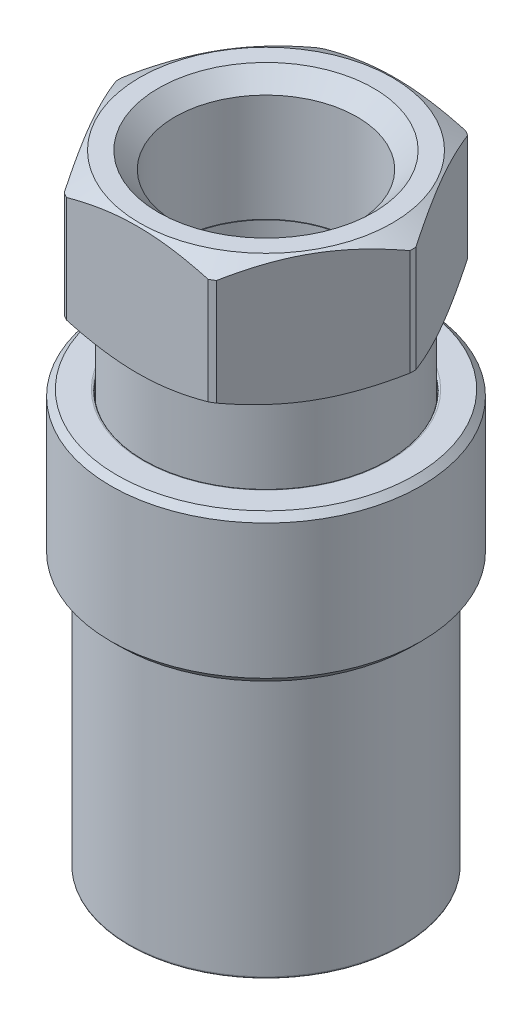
ISO-10303-21;
HEADER;
FILE_DESCRIPTION(('STEP AP214'),'2;1');
FILE_NAME('part.step','',(''),(''),'','','');
FILE_SCHEMA(('AUTOMOTIVE_DESIGN { 1 0 10303 214 1 1 1 1 }'));
ENDSEC;
DATA;
#1=APPLICATION_CONTEXT('core data for automotive mechanical design processes');
#2=APPLICATION_PROTOCOL_DEFINITION('international standard','automotive_design',2000,#1);
#3=PRODUCT_CONTEXT('',#1,'mechanical');
#4=PRODUCT('Part','Part','',(#3));
#5=PRODUCT_RELATED_PRODUCT_CATEGORY('part','',(#4));
#6=PRODUCT_DEFINITION_FORMATION('','',#4);
#7=PRODUCT_DEFINITION_CONTEXT('part definition',#1,'design');
#8=PRODUCT_DEFINITION('design','',#6,#7);
#9=PRODUCT_DEFINITION_SHAPE('','',#8);
#10=(LENGTH_UNIT() NAMED_UNIT(*) SI_UNIT(.MILLI.,.METRE.));
#11=(NAMED_UNIT(*) PLANE_ANGLE_UNIT() SI_UNIT($,.RADIAN.));
#12=(NAMED_UNIT(*) SI_UNIT($,.STERADIAN.) SOLID_ANGLE_UNIT());
#13=UNCERTAINTY_MEASURE_WITH_UNIT(LENGTH_MEASURE(1.E-05),#10,'distance_accuracy_value','');
#14=(GEOMETRIC_REPRESENTATION_CONTEXT(3) GLOBAL_UNCERTAINTY_ASSIGNED_CONTEXT((#13)) GLOBAL_UNIT_ASSIGNED_CONTEXT((#10,
#11,#12)) REPRESENTATION_CONTEXT('',''));
#15=CARTESIAN_POINT('',(0.,0.,0.));
#16=DIRECTION('',(0.,0.,1.));
#17=DIRECTION('',(1.,0.,0.));
#18=AXIS2_PLACEMENT_3D('',#15,#16,#17);
#19=CARTESIAN_POINT('',(0.,25.2095,0.));
#20=DIRECTION('',(0.,-1.,0.));
#21=DIRECTION('',(0.,0.,-1.));
#22=AXIS2_PLACEMENT_3D('',#19,#20,#21);
#23=CONICAL_SURFACE('',#22,9.3345,0.785398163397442);
#24=CARTESIAN_POINT('',(0.,25.4,0.));
#25=DIRECTION('',(0.,-1.,0.));
#26=DIRECTION('',(0.,0.,-1.));
#27=AXIS2_PLACEMENT_3D('',#24,#25,#26);
#28=CIRCLE('',#27,9.144);
#29=CARTESIAN_POINT('',(0.,25.4,9.144));
#30=VERTEX_POINT('',#29);
#31=EDGE_CURVE('P0_E11',#30,#30,#28,.T.);
#32=ORIENTED_EDGE('',*,*,#31,.T.);
#33=DIRECTION('',(0.,-0.707106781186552,0.707106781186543));
#34=VECTOR('',#33,1.);
#35=CARTESIAN_POINT('',(0.,25.2095,9.3345));
#36=LINE('',#35,#34);
#37=CARTESIAN_POINT('',(0.,25.019,9.525));
#38=VERTEX_POINT('',#37);
#39=EDGE_CURVE('P0_E27',#30,#38,#36,.T.);
#40=ORIENTED_EDGE('',*,*,#39,.T.);
#41=CARTESIAN_POINT('',(0.,25.019,0.));
#42=DIRECTION('',(0.,1.,0.));
#43=DIRECTION('',(0.,0.,-1.));
#44=AXIS2_PLACEMENT_3D('',#41,#42,#43);
#45=CIRCLE('',#44,9.525);
#46=CARTESIAN_POINT('',(0.,25.019,-9.525));
#47=VERTEX_POINT('',#46);
#48=EDGE_CURVE('P0_E192',#38,#47,#45,.T.);
#49=ORIENTED_EDGE('',*,*,#48,.T.);
#50=CARTESIAN_POINT('',(0.,25.019,0.));
#51=DIRECTION('',(0.,1.,0.));
#52=DIRECTION('',(0.,0.,-1.));
#53=AXIS2_PLACEMENT_3D('',#50,#51,#52);
#54=CIRCLE('',#53,9.525);
#55=EDGE_CURVE('P0_E254',#47,#38,#54,.T.);
#56=ORIENTED_EDGE('',*,*,#55,.T.);
#57=ORIENTED_EDGE('',*,*,#39,.F.);
#58=EDGE_LOOP('',(#32,#40,#49,#56,#57));
#59=FACE_BOUND('',#58,.T.);
#60=ADVANCED_FACE('P0_F16',(#59),#23,.T.);
#61=CARTESIAN_POINT('',(0.,20.828,0.));
#62=DIRECTION('',(0.,1.,0.));
#63=DIRECTION('',(0.,0.,1.));
#64=AXIS2_PLACEMENT_3D('',#61,#62,#63);
#65=CYLINDRICAL_SURFACE('',#64,9.525);
#66=ORIENTED_EDGE('',*,*,#48,.F.);
#67=ORIENTED_EDGE('',*,*,#55,.F.);
#68=DIRECTION('',(0.,-1.,0.));
#69=VECTOR('',#68,1.);
#70=CARTESIAN_POINT('',(0.,20.828,-9.525));
#71=LINE('',#70,#69);
#72=CARTESIAN_POINT('',(0.,16.764,-9.525));
#73=VERTEX_POINT('',#72);
#74=EDGE_CURVE('P0_E246',#47,#73,#71,.T.);
#75=ORIENTED_EDGE('',*,*,#74,.T.);
#76=CARTESIAN_POINT('',(0.,16.764,0.));
#77=DIRECTION('',(0.,-1.,0.));
#78=DIRECTION('',(0.,0.,-1.));
#79=AXIS2_PLACEMENT_3D('',#76,#77,#78);
#80=CIRCLE('',#79,9.525);
#81=CARTESIAN_POINT('',(0.,16.764,9.525));
#82=VERTEX_POINT('',#81);
#83=EDGE_CURVE('P0_E198',#82,#73,#80,.T.);
#84=ORIENTED_EDGE('',*,*,#83,.F.);
#85=CARTESIAN_POINT('',(0.,16.764,0.));
#86=DIRECTION('',(0.,-1.,0.));
#87=DIRECTION('',(0.,0.,-1.));
#88=AXIS2_PLACEMENT_3D('',#85,#86,#87);
#89=CIRCLE('',#88,9.525);
#90=EDGE_CURVE('P0_E216',#73,#82,#89,.T.);
#91=ORIENTED_EDGE('',*,*,#90,.F.);
#92=ORIENTED_EDGE('',*,*,#74,.F.);
#93=EDGE_LOOP('',(#66,#67,#75,#84,#91,#92));
#94=FACE_BOUND('',#93,.T.);
#95=ADVANCED_FACE('P0_F313',(#94),#65,.T.);
#96=CARTESIAN_POINT('',(0.,25.4,7.4549));
#97=DIRECTION('',(0.,1.,0.));
#98=DIRECTION('',(1.,0.,0.));
#99=AXIS2_PLACEMENT_3D('',#96,#97,#98);
#100=PLANE('',#99);
#101=ORIENTED_EDGE('',*,*,#31,.F.);
#102=EDGE_LOOP('',(#101));
#103=FACE_BOUND('',#102,.T.);
#104=CARTESIAN_POINT('',(0.,25.4,0.));
#105=DIRECTION('',(0.,1.,0.));
#106=DIRECTION('',(0.,0.,-1.));
#107=AXIS2_PLACEMENT_3D('',#104,#105,#106);
#108=CIRCLE('',#107,7.5819);
#109=CARTESIAN_POINT('',(0.,25.4,7.5819));
#110=VERTEX_POINT('',#109);
#111=CARTESIAN_POINT('',(0.,25.4,-7.5819));
#112=VERTEX_POINT('',#111);
#113=EDGE_CURVE('P0_E237',#110,#112,#108,.T.);
#114=ORIENTED_EDGE('',*,*,#113,.F.);
#115=CARTESIAN_POINT('',(0.,25.4,0.));
#116=DIRECTION('',(0.,1.,0.));
#117=DIRECTION('',(0.,0.,-1.));
#118=AXIS2_PLACEMENT_3D('',#115,#116,#117);
#119=CIRCLE('',#118,7.5819);
#120=EDGE_CURVE('P0_E240',#112,#110,#119,.T.);
#121=ORIENTED_EDGE('',*,*,#120,.F.);
#122=EDGE_LOOP('',(#114,#121));
#123=FACE_BOUND('',#122,.T.);
#124=ADVANCED_FACE('P0_F310',(#103,#123),#100,.T.);
#125=CARTESIAN_POINT('',(0.,6.096,0.));
#126=DIRECTION('',(0.,1.,0.));
#127=DIRECTION('',(0.,0.,1.));
#128=AXIS2_PLACEMENT_3D('',#125,#126,#127);
#129=TOROIDAL_SURFACE('',#128,6.6802,0.254);
#130=CARTESIAN_POINT('',(0.,6.096,0.));
#131=DIRECTION('',(0.,-1.,0.));
#132=DIRECTION('',(0.,0.,-1.));
#133=AXIS2_PLACEMENT_3D('',#130,#131,#132);
#134=CIRCLE('',#133,6.4262);
#135=CARTESIAN_POINT('',(0.,6.096,6.4262));
#136=VERTEX_POINT('',#135);
#137=CARTESIAN_POINT('',(0.,6.096,-6.4262));
#138=VERTEX_POINT('',#137);
#139=EDGE_CURVE('P0_E242',#136,#138,#134,.T.);
#140=ORIENTED_EDGE('',*,*,#139,.T.);
#141=CARTESIAN_POINT('',(0.,6.096,-6.6802));
#142=DIRECTION('',(-1.,0.,0.));
#143=DIRECTION('',(0.,0.,-1.));
#144=AXIS2_PLACEMENT_3D('',#141,#142,#143);
#145=CIRCLE('',#144,0.254);
#146=CARTESIAN_POINT('',(0.,6.35,-6.6802));
#147=VERTEX_POINT('',#146);
#148=EDGE_CURVE('P0_E247',#138,#147,#145,.T.);
#149=ORIENTED_EDGE('',*,*,#148,.T.);
#150=CARTESIAN_POINT('',(0.,6.35,0.));
#151=DIRECTION('',(0.,1.,0.));
#152=DIRECTION('',(0.,0.,-1.));
#153=AXIS2_PLACEMENT_3D('',#150,#151,#152);
#154=CIRCLE('',#153,6.6802);
#155=CARTESIAN_POINT('',(0.,6.35,6.6802));
#156=VERTEX_POINT('',#155);
#157=EDGE_CURVE('P0_E271',#147,#156,#154,.T.);
#158=ORIENTED_EDGE('',*,*,#157,.T.);
#159=CARTESIAN_POINT('',(0.,6.35,0.));
#160=DIRECTION('',(0.,1.,0.));
#161=DIRECTION('',(0.,0.,-1.));
#162=AXIS2_PLACEMENT_3D('',#159,#160,#161);
#163=CIRCLE('',#162,6.6802);
#164=EDGE_CURVE('P0_E297',#156,#147,#163,.T.);
#165=ORIENTED_EDGE('',*,*,#164,.T.);
#166=ORIENTED_EDGE('',*,*,#148,.F.);
#167=CARTESIAN_POINT('',(0.,6.096,0.));
#168=DIRECTION('',(0.,-1.,0.));
#169=DIRECTION('',(0.,0.,-1.));
#170=AXIS2_PLACEMENT_3D('',#167,#168,#169);
#171=CIRCLE('',#170,6.4262);
#172=EDGE_CURVE('P0_E207',#138,#136,#171,.T.);
#173=ORIENTED_EDGE('',*,*,#172,.T.);
#174=EDGE_LOOP('',(#140,#149,#158,#165,#166,#173));
#175=FACE_BOUND('',#174,.T.);
#176=ADVANCED_FACE('P0_F312',(#175),#129,.T.);
#177=CARTESIAN_POINT('',(0.,6.35,6.4262));
#178=DIRECTION('',(0.,1.,0.));
#179=DIRECTION('',(1.,0.,0.));
#180=AXIS2_PLACEMENT_3D('',#177,#178,#179);
#181=PLANE('',#180);
#182=CARTESIAN_POINT('',(0.,6.35,0.));
#183=DIRECTION('',(0.,-1.,0.));
#184=DIRECTION('',(0.,0.,-1.));
#185=AXIS2_PLACEMENT_3D('',#182,#183,#184);
#186=CIRCLE('',#185,7.2009);
#187=CARTESIAN_POINT('',(0.,6.35,7.2009));
#188=VERTEX_POINT('',#187);
#189=CARTESIAN_POINT('',(0.,6.35,-7.2009));
#190=VERTEX_POINT('',#189);
#191=EDGE_CURVE('P0_E234',#188,#190,#186,.T.);
#192=ORIENTED_EDGE('',*,*,#191,.F.);
#193=CARTESIAN_POINT('',(0.,6.35,0.));
#194=DIRECTION('',(0.,-1.,0.));
#195=DIRECTION('',(0.,0.,-1.));
#196=AXIS2_PLACEMENT_3D('',#193,#194,#195);
#197=CIRCLE('',#196,7.2009);
#198=EDGE_CURVE('P0_E204',#190,#188,#197,.T.);
#199=ORIENTED_EDGE('',*,*,#198,.F.);
#200=EDGE_LOOP('',(#192,#199));
#201=FACE_BOUND('',#200,.T.);
#202=ORIENTED_EDGE('',*,*,#164,.F.);
#203=ORIENTED_EDGE('',*,*,#157,.F.);
#204=EDGE_LOOP('',(#202,#203));
#205=FACE_BOUND('',#204,.T.);
#206=ADVANCED_FACE('P0_F320',(#201,#205),#181,.T.);
#207=CARTESIAN_POINT('',(0.,4.1402,0.));
#208=DIRECTION('',(0.,1.,0.));
#209=DIRECTION('',(0.,0.,1.));
#210=AXIS2_PLACEMENT_3D('',#207,#208,#209);
#211=CYLINDRICAL_SURFACE('',#210,6.4262);
#212=ORIENTED_EDGE('',*,*,#139,.F.);
#213=ORIENTED_EDGE('',*,*,#172,.F.);
#214=DIRECTION('',(0.,-1.,0.));
#215=VECTOR('',#214,1.);
#216=CARTESIAN_POINT('',(0.,4.1402,-6.4262));
#217=LINE('',#216,#215);
#218=CARTESIAN_POINT('',(0.,1.9304,-6.4262));
#219=VERTEX_POINT('',#218);
#220=EDGE_CURVE('P0_E170',#138,#219,#217,.T.);
#221=ORIENTED_EDGE('',*,*,#220,.T.);
#222=CARTESIAN_POINT('',(0.,1.9304,0.));
#223=DIRECTION('',(0.,1.,0.));
#224=DIRECTION('',(1.,0.,0.));
#225=AXIS2_PLACEMENT_3D('',#222,#223,#224);
#226=CIRCLE('',#225,6.4262);
#227=CARTESIAN_POINT('',(0.,1.9304,6.4262));
#228=VERTEX_POINT('',#227);
#229=EDGE_CURVE('P0_E165',#228,#219,#226,.T.);
#230=ORIENTED_EDGE('',*,*,#229,.F.);
#231=CARTESIAN_POINT('',(0.,1.9304,0.));
#232=DIRECTION('',(0.,1.,0.));
#233=DIRECTION('',(1.,0.,0.));
#234=AXIS2_PLACEMENT_3D('',#231,#232,#233);
#235=CIRCLE('',#234,6.4262);
#236=EDGE_CURVE('P0_E169',#219,#228,#235,.T.);
#237=ORIENTED_EDGE('',*,*,#236,.F.);
#238=ORIENTED_EDGE('',*,*,#220,.F.);
#239=EDGE_LOOP('',(#212,#213,#221,#230,#237,#238));
#240=FACE_BOUND('',#239,.T.);
#241=ADVANCED_FACE('P0_F167',(#240),#211,.F.);
#242=CARTESIAN_POINT('',(0.,6.604,0.));
#243=DIRECTION('',(0.,1.,0.));
#244=DIRECTION('',(0.,0.,1.));
#245=AXIS2_PLACEMENT_3D('',#242,#243,#244);
#246=TOROIDAL_SURFACE('',#245,7.2009,0.254);
#247=CARTESIAN_POINT('',(0.,6.604,0.));
#248=DIRECTION('',(0.,1.,0.));
#249=DIRECTION('',(0.,0.,-1.));
#250=AXIS2_PLACEMENT_3D('',#247,#248,#249);
#251=CIRCLE('',#250,7.4549);
#252=CARTESIAN_POINT('',(0.,6.604,7.4549));
#253=VERTEX_POINT('',#252);
#254=CARTESIAN_POINT('',(0.,6.604,-7.4549));
#255=VERTEX_POINT('',#254);
#256=EDGE_CURVE('P0_E203',#253,#255,#251,.T.);
#257=ORIENTED_EDGE('',*,*,#256,.T.);
#258=CARTESIAN_POINT('',(0.,6.604,-7.2009));
#259=DIRECTION('',(-1.,0.,0.));
#260=DIRECTION('',(0.,0.,-1.));
#261=AXIS2_PLACEMENT_3D('',#258,#259,#260);
#262=CIRCLE('',#261,0.254);
#263=EDGE_CURVE('P0_E199',#255,#190,#262,.T.);
#264=ORIENTED_EDGE('',*,*,#263,.T.);
#265=ORIENTED_EDGE('',*,*,#198,.T.);
#266=ORIENTED_EDGE('',*,*,#191,.T.);
#267=ORIENTED_EDGE('',*,*,#263,.F.);
#268=CARTESIAN_POINT('',(0.,6.604,0.));
#269=DIRECTION('',(0.,1.,0.));
#270=DIRECTION('',(0.,0.,-1.));
#271=AXIS2_PLACEMENT_3D('',#268,#269,#270);
#272=CIRCLE('',#271,7.4549);
#273=EDGE_CURVE('P0_E197',#255,#253,#272,.T.);
#274=ORIENTED_EDGE('',*,*,#273,.T.);
#275=EDGE_LOOP('',(#257,#264,#265,#266,#267,#274));
#276=FACE_BOUND('',#275,.T.);
#277=ADVANCED_FACE('P0_F343',(#276),#246,.F.);
#278=CARTESIAN_POINT('',(0.,15.875,0.));
#279=DIRECTION('',(0.,1.,0.));
#280=DIRECTION('',(0.,0.,1.));
#281=AXIS2_PLACEMENT_3D('',#278,#279,#280);
#282=CYLINDRICAL_SURFACE('',#281,7.4549);
#283=CARTESIAN_POINT('',(0.,25.273,0.));
#284=DIRECTION('',(0.,-1.,0.));
#285=DIRECTION('',(0.,0.,-1.));
#286=AXIS2_PLACEMENT_3D('',#283,#284,#285);
#287=CIRCLE('',#286,7.4549);
#288=CARTESIAN_POINT('',(0.,25.273,7.4549));
#289=VERTEX_POINT('',#288);
#290=CARTESIAN_POINT('',(0.,25.273,-7.4549));
#291=VERTEX_POINT('',#290);
#292=EDGE_CURVE('P0_E253',#289,#291,#287,.T.);
#293=ORIENTED_EDGE('',*,*,#292,.F.);
#294=CARTESIAN_POINT('',(0.,25.273,0.));
#295=DIRECTION('',(0.,-1.,0.));
#296=DIRECTION('',(0.,0.,-1.));
#297=AXIS2_PLACEMENT_3D('',#294,#295,#296);
#298=CIRCLE('',#297,7.4549);
#299=EDGE_CURVE('P0_E241',#291,#289,#298,.T.);
#300=ORIENTED_EDGE('',*,*,#299,.F.);
#301=DIRECTION('',(0.,-1.,0.));
#302=VECTOR('',#301,1.);
#303=CARTESIAN_POINT('',(0.,15.875,-7.4549));
#304=LINE('',#303,#302);
#305=EDGE_CURVE('P0_E193',#291,#255,#304,.T.);
#306=ORIENTED_EDGE('',*,*,#305,.T.);
#307=ORIENTED_EDGE('',*,*,#256,.F.);
#308=ORIENTED_EDGE('',*,*,#273,.F.);
#309=ORIENTED_EDGE('',*,*,#305,.F.);
#310=EDGE_LOOP('',(#293,#300,#306,#307,#308,#309));
#311=FACE_BOUND('',#310,.T.);
#312=ADVANCED_FACE('P0_F341',(#311),#282,.F.);
#313=CARTESIAN_POINT('',(0.,16.51,0.));
#314=DIRECTION('',(0.,1.,0.));
#315=DIRECTION('',(0.,0.,-1.));
#316=AXIS2_PLACEMENT_3D('',#313,#314,#315);
#317=CONICAL_SURFACE('',#316,9.271,0.785398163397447);
#318=ORIENTED_EDGE('',*,*,#83,.T.);
#319=ORIENTED_EDGE('',*,*,#90,.T.);
#320=DIRECTION('',(0.,-0.707106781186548,-0.707106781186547));
#321=VECTOR('',#320,1.);
#322=CARTESIAN_POINT('',(0.,16.51,9.271));
#323=LINE('',#322,#321);
#324=CARTESIAN_POINT('',(0.,16.256,9.017));
#325=VERTEX_POINT('',#324);
#326=EDGE_CURVE('P0_E221',#82,#325,#323,.T.);
#327=ORIENTED_EDGE('',*,*,#326,.T.);
#328=CARTESIAN_POINT('',(0.,16.256,0.));
#329=DIRECTION('',(0.,1.,0.));
#330=DIRECTION('',(0.,0.,-1.));
#331=AXIS2_PLACEMENT_3D('',#328,#329,#330);
#332=CIRCLE('',#331,9.017);
#333=EDGE_CURVE('P0_E217',#325,#325,#332,.T.);
#334=ORIENTED_EDGE('',*,*,#333,.T.);
#335=ORIENTED_EDGE('',*,*,#326,.F.);
#336=EDGE_LOOP('',(#318,#319,#327,#334,#335));
#337=FACE_BOUND('',#336,.T.);
#338=ADVANCED_FACE('P0_F339',(#337),#317,.T.);
#339=CARTESIAN_POINT('',(0.,16.256,9.525));
#340=DIRECTION('',(0.,-1.,0.));
#341=DIRECTION('',(0.,0.,-1.));
#342=AXIS2_PLACEMENT_3D('',#339,#340,#341);
#343=PLANE('',#342);
#344=ORIENTED_EDGE('',*,*,#333,.F.);
#345=EDGE_LOOP('',(#344));
#346=FACE_BOUND('',#345,.T.);
#347=CARTESIAN_POINT('',(0.,16.256,0.));
#348=DIRECTION('',(0.,1.,0.));
#349=DIRECTION('',(1.,0.,0.));
#350=AXIS2_PLACEMENT_3D('',#347,#348,#349);
#351=CIRCLE('',#350,8.4328);
#352=CARTESIAN_POINT('',(0.,16.256,8.4328));
#353=VERTEX_POINT('',#352);
#354=CARTESIAN_POINT('',(0.,16.256,-8.4328));
#355=VERTEX_POINT('',#354);
#356=EDGE_CURVE('P0_E222',#353,#355,#351,.T.);
#357=ORIENTED_EDGE('',*,*,#356,.T.);
#358=CARTESIAN_POINT('',(0.,16.256,0.));
#359=DIRECTION('',(0.,1.,0.));
#360=DIRECTION('',(1.,0.,0.));
#361=AXIS2_PLACEMENT_3D('',#358,#359,#360);
#362=CIRCLE('',#361,8.4328);
#363=EDGE_CURVE('P0_E20',#355,#353,#362,.T.);
#364=ORIENTED_EDGE('',*,*,#363,.T.);
#365=EDGE_LOOP('',(#357,#364));
#366=FACE_BOUND('',#365,.T.);
#367=ADVANCED_FACE('P0_F335',(#346,#366),#343,.T.);
#368=CARTESIAN_POINT('',(0.,0.127,0.));
#369=DIRECTION('',(0.,1.,0.));
#370=DIRECTION('',(0.,0.,1.));
#371=AXIS2_PLACEMENT_3D('',#368,#369,#370);
#372=TOROIDAL_SURFACE('',#371,8.3058,0.127);
#373=CARTESIAN_POINT('',(0.,0.127,0.));
#374=DIRECTION('',(0.,-1.,0.));
#375=DIRECTION('',(0.,0.,-1.));
#376=AXIS2_PLACEMENT_3D('',#373,#374,#375);
#377=CIRCLE('',#376,8.4328);
#378=CARTESIAN_POINT('',(0.,0.127,8.4328));
#379=VERTEX_POINT('',#378);
#380=CARTESIAN_POINT('',(0.,0.127,-8.4328));
#381=VERTEX_POINT('',#380);
#382=EDGE_CURVE('P0_E223',#379,#381,#377,.T.);
#383=ORIENTED_EDGE('',*,*,#382,.T.);
#384=CARTESIAN_POINT('',(0.,0.127,-8.3058));
#385=DIRECTION('',(-1.,0.,0.));
#386=DIRECTION('',(0.,0.,-1.));
#387=AXIS2_PLACEMENT_3D('',#384,#385,#386);
#388=CIRCLE('',#387,0.127);
#389=CARTESIAN_POINT('',(0.,0.,-8.3058));
#390=VERTEX_POINT('',#389);
#391=EDGE_CURVE('P0_E188',#381,#390,#388,.T.);
#392=ORIENTED_EDGE('',*,*,#391,.T.);
#393=CARTESIAN_POINT('',(0.,0.,0.));
#394=DIRECTION('',(0.,1.,0.));
#395=DIRECTION('',(0.,0.,-1.));
#396=AXIS2_PLACEMENT_3D('',#393,#394,#395);
#397=CIRCLE('',#396,8.3058);
#398=CARTESIAN_POINT('',(0.,0.,8.3058));
#399=VERTEX_POINT('',#398);
#400=EDGE_CURVE('P0_E52',#390,#399,#397,.T.);
#401=ORIENTED_EDGE('',*,*,#400,.T.);
#402=CARTESIAN_POINT('',(0.,0.,0.));
#403=DIRECTION('',(0.,1.,0.));
#404=DIRECTION('',(0.,0.,-1.));
#405=AXIS2_PLACEMENT_3D('',#402,#403,#404);
#406=CIRCLE('',#405,8.3058);
#407=EDGE_CURVE('P0_E264',#399,#390,#406,.T.);
#408=ORIENTED_EDGE('',*,*,#407,.T.);
#409=ORIENTED_EDGE('',*,*,#391,.F.);
#410=CARTESIAN_POINT('',(0.,0.127,0.));
#411=DIRECTION('',(0.,-1.,0.));
#412=DIRECTION('',(0.,0.,-1.));
#413=AXIS2_PLACEMENT_3D('',#410,#411,#412);
#414=CIRCLE('',#413,8.4328);
#415=EDGE_CURVE('P0_E252',#381,#379,#414,.T.);
#416=ORIENTED_EDGE('',*,*,#415,.T.);
#417=EDGE_LOOP('',(#383,#392,#401,#408,#409,#416));
#418=FACE_BOUND('',#417,.T.);
#419=ADVANCED_FACE('P0_F338',(#418),#372,.T.);
#420=CARTESIAN_POINT('',(0.,0.,8.4328));
#421=DIRECTION('',(0.,-1.,0.));
#422=DIRECTION('',(0.,0.,-1.));
#423=AXIS2_PLACEMENT_3D('',#420,#421,#422);
#424=PLANE('',#423);
#425=ORIENTED_EDGE('',*,*,#407,.F.);
#426=ORIENTED_EDGE('',*,*,#400,.F.);
#427=EDGE_LOOP('',(#425,#426));
#428=FACE_BOUND('',#427,.T.);
#429=CARTESIAN_POINT('',(0.,0.,0.));
#430=DIRECTION('',(0.,-1.,0.));
#431=DIRECTION('',(0.,0.,-1.));
#432=AXIS2_PLACEMENT_3D('',#429,#430,#431);
#433=CIRCLE('',#432,7.4422);
#434=CARTESIAN_POINT('',(0.,0.,7.4422));
#435=VERTEX_POINT('',#434);
#436=CARTESIAN_POINT('',(0.,0.,-7.4422));
#437=VERTEX_POINT('',#436);
#438=EDGE_CURVE('P0_E287',#435,#437,#433,.T.);
#439=ORIENTED_EDGE('',*,*,#438,.F.);
#440=CARTESIAN_POINT('',(0.,0.,0.));
#441=DIRECTION('',(0.,-1.,0.));
#442=DIRECTION('',(0.,0.,-1.));
#443=AXIS2_PLACEMENT_3D('',#440,#441,#442);
#444=CIRCLE('',#443,7.4422);
#445=EDGE_CURVE('P0_E212',#437,#435,#444,.T.);
#446=ORIENTED_EDGE('',*,*,#445,.F.);
#447=EDGE_LOOP('',(#439,#446));
#448=FACE_BOUND('',#447,.T.);
#449=ADVANCED_FACE('P0_F332',(#428,#448),#424,.T.);
#450=CARTESIAN_POINT('',(0.,8.128,0.));
#451=DIRECTION('',(0.,1.,0.));
#452=DIRECTION('',(0.,0.,1.));
#453=AXIS2_PLACEMENT_3D('',#450,#451,#452);
#454=CYLINDRICAL_SURFACE('',#453,8.4328);
#455=ORIENTED_EDGE('',*,*,#356,.F.);
#456=ORIENTED_EDGE('',*,*,#363,.F.);
#457=DIRECTION('',(0.,-1.,0.));
#458=VECTOR('',#457,1.);
#459=CARTESIAN_POINT('',(0.,8.128,-8.4328));
#460=LINE('',#459,#458);
#461=EDGE_CURVE('P0_E248',#355,#381,#460,.T.);
#462=ORIENTED_EDGE('',*,*,#461,.T.);
#463=ORIENTED_EDGE('',*,*,#382,.F.);
#464=ORIENTED_EDGE('',*,*,#415,.F.);
#465=ORIENTED_EDGE('',*,*,#461,.F.);
#466=EDGE_LOOP('',(#455,#456,#462,#463,#464,#465));
#467=FACE_BOUND('',#466,.T.);
#468=ADVANCED_FACE('P0_F351',(#467),#454,.T.);
#469=CARTESIAN_POINT('',(0.,25.273,0.));
#470=DIRECTION('',(0.,1.,0.));
#471=DIRECTION('',(0.,0.,1.));
#472=AXIS2_PLACEMENT_3D('',#469,#470,#471);
#473=TOROIDAL_SURFACE('',#472,7.5819,0.127);
#474=ORIENTED_EDGE('',*,*,#292,.T.);
#475=CARTESIAN_POINT('',(0.,25.273,-7.5819));
#476=DIRECTION('',(-1.,0.,0.));
#477=DIRECTION('',(0.,0.,-1.));
#478=AXIS2_PLACEMENT_3D('',#475,#476,#477);
#479=CIRCLE('',#478,0.127);
#480=EDGE_CURVE('P0_E261',#291,#112,#479,.T.);
#481=ORIENTED_EDGE('',*,*,#480,.T.);
#482=ORIENTED_EDGE('',*,*,#120,.T.);
#483=ORIENTED_EDGE('',*,*,#113,.T.);
#484=ORIENTED_EDGE('',*,*,#480,.F.);
#485=ORIENTED_EDGE('',*,*,#299,.T.);
#486=EDGE_LOOP('',(#474,#481,#482,#483,#484,#485));
#487=FACE_BOUND('',#486,.T.);
#488=ADVANCED_FACE('P0_F306',(#487),#473,.T.);
#489=CARTESIAN_POINT('',(0.,0.127,0.));
#490=DIRECTION('',(0.,1.,0.));
#491=DIRECTION('',(0.,0.,1.));
#492=AXIS2_PLACEMENT_3D('',#489,#490,#491);
#493=TOROIDAL_SURFACE('',#492,7.4422,0.127);
#494=ORIENTED_EDGE('',*,*,#438,.T.);
#495=CARTESIAN_POINT('',(0.,0.127,-7.4422));
#496=DIRECTION('',(-1.,0.,0.));
#497=DIRECTION('',(0.,0.,-1.));
#498=AXIS2_PLACEMENT_3D('',#495,#496,#497);
#499=CIRCLE('',#498,0.127);
#500=CARTESIAN_POINT('',(0.,0.127,-7.3152));
#501=VERTEX_POINT('',#500);
#502=EDGE_CURVE('P0_E232',#437,#501,#499,.T.);
#503=ORIENTED_EDGE('',*,*,#502,.T.);
#504=CARTESIAN_POINT('',(0.,0.127,0.));
#505=DIRECTION('',(0.,1.,0.));
#506=DIRECTION('',(0.,0.,-1.));
#507=AXIS2_PLACEMENT_3D('',#504,#505,#506);
#508=CIRCLE('',#507,7.3152);
#509=CARTESIAN_POINT('',(0.,0.127,7.3152));
#510=VERTEX_POINT('',#509);
#511=EDGE_CURVE('P0_E229',#501,#510,#508,.T.);
#512=ORIENTED_EDGE('',*,*,#511,.T.);
#513=CARTESIAN_POINT('',(0.,0.127,0.));
#514=DIRECTION('',(0.,1.,0.));
#515=DIRECTION('',(0.,0.,-1.));
#516=AXIS2_PLACEMENT_3D('',#513,#514,#515);
#517=CIRCLE('',#516,7.3152);
#518=EDGE_CURVE('P0_E233',#510,#501,#517,.T.);
#519=ORIENTED_EDGE('',*,*,#518,.T.);
#520=ORIENTED_EDGE('',*,*,#502,.F.);
#521=ORIENTED_EDGE('',*,*,#445,.T.);
#522=EDGE_LOOP('',(#494,#503,#512,#519,#520,#521));
#523=FACE_BOUND('',#522,.T.);
#524=ADVANCED_FACE('P0_F350',(#523),#493,.T.);
#525=CARTESIAN_POINT('',(0.,0.5207,0.));
#526=DIRECTION('',(0.,1.,0.));
#527=DIRECTION('',(0.,0.,1.));
#528=AXIS2_PLACEMENT_3D('',#525,#526,#527);
#529=CYLINDRICAL_SURFACE('',#528,7.3152);
#530=CARTESIAN_POINT('',(0.,1.0414,0.));
#531=DIRECTION('',(0.,1.,0.));
#532=DIRECTION('',(1.,0.,0.));
#533=AXIS2_PLACEMENT_3D('',#530,#531,#532);
#534=CIRCLE('',#533,7.3152);
#535=CARTESIAN_POINT('',(0.,1.0414,7.3152));
#536=VERTEX_POINT('',#535);
#537=CARTESIAN_POINT('',(0.,1.0414,-7.3152));
#538=VERTEX_POINT('',#537);
#539=EDGE_CURVE('P0_E208',#536,#538,#534,.T.);
#540=ORIENTED_EDGE('',*,*,#539,.T.);
#541=DIRECTION('',(0.,-1.,0.));
#542=VECTOR('',#541,1.);
#543=CARTESIAN_POINT('',(0.,0.5207,-7.3152));
#544=LINE('',#543,#542);
#545=EDGE_CURVE('P0_E213',#538,#501,#544,.T.);
#546=ORIENTED_EDGE('',*,*,#545,.T.);
#547=ORIENTED_EDGE('',*,*,#518,.F.);
#548=ORIENTED_EDGE('',*,*,#511,.F.);
#549=ORIENTED_EDGE('',*,*,#545,.F.);
#550=CARTESIAN_POINT('',(0.,1.0414,0.));
#551=DIRECTION('',(0.,1.,0.));
#552=DIRECTION('',(1.,0.,0.));
#553=AXIS2_PLACEMENT_3D('',#550,#551,#552);
#554=CIRCLE('',#553,7.3152);
#555=EDGE_CURVE('P0_E175',#538,#536,#554,.T.);
#556=ORIENTED_EDGE('',*,*,#555,.T.);
#557=EDGE_LOOP('',(#540,#546,#547,#548,#549,#556));
#558=FACE_BOUND('',#557,.T.);
#559=ADVANCED_FACE('P0_F18',(#558),#529,.F.);
#560=CARTESIAN_POINT('',(0.,1.4859,0.));
#561=DIRECTION('',(0.,-1.,0.));
#562=DIRECTION('',(0.,0.,1.));
#563=AXIS2_PLACEMENT_3D('',#560,#561,#562);
#564=CONICAL_SURFACE('',#563,6.8707,0.78539816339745);
#565=ORIENTED_EDGE('',*,*,#229,.T.);
#566=DIRECTION('',(0.,-0.707106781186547,-0.707106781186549));
#567=VECTOR('',#566,1.);
#568=CARTESIAN_POINT('',(0.,1.4859,-6.8707));
#569=LINE('',#568,#567);
#570=EDGE_CURVE('P0_E176',#219,#538,#569,.T.);
#571=ORIENTED_EDGE('',*,*,#570,.T.);
#572=ORIENTED_EDGE('',*,*,#539,.F.);
#573=ORIENTED_EDGE('',*,*,#555,.F.);
#574=ORIENTED_EDGE('',*,*,#570,.F.);
#575=ORIENTED_EDGE('',*,*,#236,.T.);
#576=EDGE_LOOP('',(#565,#571,#572,#573,#574,#575));
#577=FACE_BOUND('',#576,.T.);
#578=ADVANCED_FACE('P0_F178',(#577),#564,.F.);
#579=CLOSED_SHELL('',(#60,#95,#124,#176,#206,#241,#277,#312,#338,#367,#419,#449,#468,#488,#524,
#559,#578));
#580=MANIFOLD_SOLID_BREP('P0_B1',#579);
#581=CARTESIAN_POINT('',(0.,0.254,0.));
#582=DIRECTION('',(0.,1.,0.));
#583=DIRECTION('',(0.,0.,1.));
#584=AXIS2_PLACEMENT_3D('',#581,#582,#583);
#585=TOROIDAL_SURFACE('',#584,6.09600000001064,0.254);
#586=CARTESIAN_POINT('',(0.,0.254,0.));
#587=DIRECTION('',(0.,-1.,0.));
#588=DIRECTION('',(0.,0.,-1.));
#589=AXIS2_PLACEMENT_3D('',#586,#587,#588);
#590=CIRCLE('',#589,6.35000000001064);
#591=CARTESIAN_POINT('',(0.,0.254,6.35000000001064));
#592=VERTEX_POINT('',#591);
#593=CARTESIAN_POINT('',(0.,0.254,-6.35000000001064));
#594=VERTEX_POINT('',#593);
#595=EDGE_CURVE('P1_E11',#592,#594,#590,.T.);
#596=ORIENTED_EDGE('',*,*,#595,.T.);
#597=CARTESIAN_POINT('',(0.,0.254,-6.09600000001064));
#598=DIRECTION('',(-1.,0.,0.));
#599=DIRECTION('',(0.,0.,-1.));
#600=AXIS2_PLACEMENT_3D('',#597,#598,#599);
#601=CIRCLE('',#600,0.254);
#602=CARTESIAN_POINT('',(0.,0.,-6.09600000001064));
#603=VERTEX_POINT('',#602);
#604=EDGE_CURVE('P1_E27',#594,#603,#601,.T.);
#605=ORIENTED_EDGE('',*,*,#604,.T.);
#606=CARTESIAN_POINT('',(0.,0.,0.));
#607=DIRECTION('',(0.,1.,0.));
#608=DIRECTION('',(0.,0.,-1.));
#609=AXIS2_PLACEMENT_3D('',#606,#607,#608);
#610=CIRCLE('',#609,6.09600000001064);
#611=CARTESIAN_POINT('',(0.,0.,6.09600000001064));
#612=VERTEX_POINT('',#611);
#613=EDGE_CURVE('P1_E466',#603,#612,#610,.T.);
#614=ORIENTED_EDGE('',*,*,#613,.T.);
#615=CARTESIAN_POINT('',(0.,0.,0.));
#616=DIRECTION('',(0.,1.,0.));
#617=DIRECTION('',(0.,0.,-1.));
#618=AXIS2_PLACEMENT_3D('',#615,#616,#617);
#619=CIRCLE('',#618,6.09600000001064);
#620=EDGE_CURVE('P1_E462',#612,#603,#619,.T.);
#621=ORIENTED_EDGE('',*,*,#620,.T.);
#622=ORIENTED_EDGE('',*,*,#604,.F.);
#623=CARTESIAN_POINT('',(0.,0.254,0.));
#624=DIRECTION('',(0.,-1.,0.));
#625=DIRECTION('',(0.,0.,-1.));
#626=AXIS2_PLACEMENT_3D('',#623,#624,#625);
#627=CIRCLE('',#626,6.35000000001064);
#628=EDGE_CURVE('P1_E41',#594,#592,#627,.T.);
#629=ORIENTED_EDGE('',*,*,#628,.T.);
#630=EDGE_LOOP('',(#596,#605,#614,#621,#622,#629));
#631=FACE_BOUND('',#630,.T.);
#632=ADVANCED_FACE('P1_F16',(#631),#585,.T.);
#633=CARTESIAN_POINT('',(0.,0.,6.35000000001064));
#634=DIRECTION('',(0.,-1.,0.));
#635=DIRECTION('',(0.,0.,-1.));
#636=AXIS2_PLACEMENT_3D('',#633,#634,#635);
#637=PLANE('',#636);
#638=ORIENTED_EDGE('',*,*,#620,.F.);
#639=ORIENTED_EDGE('',*,*,#613,.F.);
#640=EDGE_LOOP('',(#638,#639));
#641=FACE_BOUND('',#640,.T.);
#642=CARTESIAN_POINT('',(0.,0.,0.));
#643=DIRECTION('',(0.,-1.,0.));
#644=DIRECTION('',(0.,0.,-1.));
#645=AXIS2_PLACEMENT_3D('',#642,#643,#644);
#646=CIRCLE('',#645,5.5372);
#647=CARTESIAN_POINT('',(0.,0.,5.5372));
#648=VERTEX_POINT('',#647);
#649=EDGE_CURVE('P1_E357',#648,#648,#646,.T.);
#650=ORIENTED_EDGE('',*,*,#649,.F.);
#651=EDGE_LOOP('',(#650));
#652=FACE_BOUND('',#651,.T.);
#653=ADVANCED_FACE('P1_F797',(#641,#652),#637,.T.);
#654=CARTESIAN_POINT('',(0.,7.62,0.));
#655=DIRECTION('',(0.,1.,0.));
#656=DIRECTION('',(0.,0.,1.));
#657=AXIS2_PLACEMENT_3D('',#654,#655,#656);
#658=CYLINDRICAL_SURFACE('',#657,6.35000000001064);
#659=CARTESIAN_POINT('',(0.,15.24,0.));
#660=DIRECTION('',(0.,1.,0.));
#661=DIRECTION('',(1.,0.,0.));
#662=AXIS2_PLACEMENT_3D('',#659,#660,#661);
#663=CIRCLE('',#662,6.35000000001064);
#664=CARTESIAN_POINT('',(0.,15.24,6.35000000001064));
#665=VERTEX_POINT('',#664);
#666=CARTESIAN_POINT('',(0.,15.24,-6.35000000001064));
#667=VERTEX_POINT('',#666);
#668=EDGE_CURVE('P1_E341',#665,#667,#663,.T.);
#669=ORIENTED_EDGE('',*,*,#668,.F.);
#670=CARTESIAN_POINT('',(0.,15.24,0.));
#671=DIRECTION('',(0.,1.,0.));
#672=DIRECTION('',(1.,0.,0.));
#673=AXIS2_PLACEMENT_3D('',#670,#671,#672);
#674=CIRCLE('',#673,6.35000000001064);
#675=EDGE_CURVE('P1_E333',#667,#665,#674,.T.);
#676=ORIENTED_EDGE('',*,*,#675,.F.);
#677=DIRECTION('',(0.,-1.,0.));
#678=VECTOR('',#677,1.);
#679=CARTESIAN_POINT('',(0.,7.62,-6.35000000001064));
#680=LINE('',#679,#678);
#681=EDGE_CURVE('P1_E400',#667,#594,#680,.T.);
#682=ORIENTED_EDGE('',*,*,#681,.T.);
#683=ORIENTED_EDGE('',*,*,#595,.F.);
#684=ORIENTED_EDGE('',*,*,#628,.F.);
#685=ORIENTED_EDGE('',*,*,#681,.F.);
#686=EDGE_LOOP('',(#669,#676,#682,#683,#684,#685));
#687=FACE_BOUND('',#686,.T.);
#688=ADVANCED_FACE('P1_F800',(#687),#658,.T.);
#689=CARTESIAN_POINT('',(0.,13.1064,0.));
#690=DIRECTION('',(0.,1.,0.));
#691=DIRECTION('',(0.,0.,1.));
#692=AXIS2_PLACEMENT_3D('',#689,#690,#691);
#693=TOROIDAL_SURFACE('',#692,3.8227,0.254);
#694=CARTESIAN_POINT('',(0.,12.8524,0.));
#695=DIRECTION('',(0.,-1.,0.));
#696=DIRECTION('',(0.,0.,-1.));
#697=AXIS2_PLACEMENT_3D('',#694,#695,#696);
#698=CIRCLE('',#697,3.8227);
#699=CARTESIAN_POINT('',(0.,12.8524,3.8227));
#700=VERTEX_POINT('',#699);
#701=CARTESIAN_POINT('',(0.,12.8524,-3.8227));
#702=VERTEX_POINT('',#701);
#703=EDGE_CURVE('P1_E404',#700,#702,#698,.T.);
#704=ORIENTED_EDGE('',*,*,#703,.T.);
#705=CARTESIAN_POINT('',(0.,13.1064,-3.8227));
#706=DIRECTION('',(-1.,0.,0.));
#707=DIRECTION('',(0.,0.,-1.));
#708=AXIS2_PLACEMENT_3D('',#705,#706,#707);
#709=CIRCLE('',#708,0.254);
#710=CARTESIAN_POINT('',(0.,13.1064,-3.5687));
#711=VERTEX_POINT('',#710);
#712=EDGE_CURVE('P1_E429',#702,#711,#709,.T.);
#713=ORIENTED_EDGE('',*,*,#712,.T.);
#714=CARTESIAN_POINT('',(0.,13.1064,0.));
#715=DIRECTION('',(0.,1.,0.));
#716=DIRECTION('',(0.,0.,-1.));
#717=AXIS2_PLACEMENT_3D('',#714,#715,#716);
#718=CIRCLE('',#717,3.5687);
#719=CARTESIAN_POINT('',(0.,13.1064,3.5687));
#720=VERTEX_POINT('',#719);
#721=EDGE_CURVE('P1_E515',#711,#720,#718,.T.);
#722=ORIENTED_EDGE('',*,*,#721,.T.);
#723=CARTESIAN_POINT('',(0.,13.1064,0.));
#724=DIRECTION('',(0.,1.,0.));
#725=DIRECTION('',(0.,0.,-1.));
#726=AXIS2_PLACEMENT_3D('',#723,#724,#725);
#727=CIRCLE('',#726,3.5687);
#728=EDGE_CURVE('P1_E535',#720,#711,#727,.T.);
#729=ORIENTED_EDGE('',*,*,#728,.T.);
#730=ORIENTED_EDGE('',*,*,#712,.F.);
#731=CARTESIAN_POINT('',(0.,12.8524,0.));
#732=DIRECTION('',(0.,-1.,0.));
#733=DIRECTION('',(0.,0.,-1.));
#734=AXIS2_PLACEMENT_3D('',#731,#732,#733);
#735=CIRCLE('',#734,3.8227);
#736=EDGE_CURVE('P1_E471',#702,#700,#735,.T.);
#737=ORIENTED_EDGE('',*,*,#736,.T.);
#738=EDGE_LOOP('',(#704,#713,#722,#729,#730,#737));
#739=FACE_BOUND('',#738,.T.);
#740=ADVANCED_FACE('P1_F807',(#739),#693,.T.);
#741=CARTESIAN_POINT('',(0.,19.2024,0.));
#742=DIRECTION('',(0.,1.,0.));
#743=DIRECTION('',(0.,0.,1.));
#744=AXIS2_PLACEMENT_3D('',#741,#742,#743);
#745=CYLINDRICAL_SURFACE('',#744,3.5687);
#746=CARTESIAN_POINT('',(0.,23.6903600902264,0.));
#747=DIRECTION('',(0.,1.,0.));
#748=DIRECTION('',(0.,0.,1.));
#749=AXIS2_PLACEMENT_3D('',#746,#747,#748);
#750=CIRCLE('',#749,3.5687);
#751=CARTESIAN_POINT('',(0.,23.6903600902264,-3.5687));
#752=VERTEX_POINT('',#751);
#753=EDGE_CURVE('P1_E467',#752,#752,#750,.T.);
#754=ORIENTED_EDGE('',*,*,#753,.T.);
#755=DIRECTION('',(0.,-1.,0.));
#756=VECTOR('',#755,1.);
#757=CARTESIAN_POINT('',(0.,19.2024,-3.5687));
#758=LINE('',#757,#756);
#759=EDGE_CURVE('P1_E472',#752,#711,#758,.T.);
#760=ORIENTED_EDGE('',*,*,#759,.T.);
#761=ORIENTED_EDGE('',*,*,#728,.F.);
#762=ORIENTED_EDGE('',*,*,#721,.F.);
#763=ORIENTED_EDGE('',*,*,#759,.F.);
#764=EDGE_LOOP('',(#754,#760,#761,#762,#763));
#765=FACE_BOUND('',#764,.T.);
#766=ADVANCED_FACE('P1_F816',(#765),#745,.F.);
#767=CARTESIAN_POINT('',(0.,12.8524,5.0546));
#768=DIRECTION('',(0.,-1.,0.));
#769=DIRECTION('',(0.,0.,-1.));
#770=AXIS2_PLACEMENT_3D('',#767,#768,#769);
#771=PLANE('',#770);
#772=CARTESIAN_POINT('',(0.,12.8524,0.));
#773=DIRECTION('',(0.,1.,0.));
#774=DIRECTION('',(1.,0.,0.));
#775=AXIS2_PLACEMENT_3D('',#772,#773,#774);
#776=CIRCLE('',#775,5.0546);
#777=CARTESIAN_POINT('',(0.,12.8524,5.0546));
#778=VERTEX_POINT('',#777);
#779=CARTESIAN_POINT('',(0.,12.8524,-5.0546));
#780=VERTEX_POINT('',#779);
#781=EDGE_CURVE('P1_E685',#778,#780,#776,.T.);
#782=ORIENTED_EDGE('',*,*,#781,.F.);
#783=CARTESIAN_POINT('',(0.,12.8524,0.));
#784=DIRECTION('',(0.,1.,0.));
#785=DIRECTION('',(1.,0.,0.));
#786=AXIS2_PLACEMENT_3D('',#783,#784,#785);
#787=CIRCLE('',#786,5.0546);
#788=EDGE_CURVE('P1_E456',#780,#778,#787,.T.);
#789=ORIENTED_EDGE('',*,*,#788,.F.);
#790=EDGE_LOOP('',(#782,#789));
#791=FACE_BOUND('',#790,.T.);
#792=ORIENTED_EDGE('',*,*,#703,.F.);
#793=ORIENTED_EDGE('',*,*,#736,.F.);
#794=EDGE_LOOP('',(#792,#793));
#795=FACE_BOUND('',#794,.T.);
#796=ADVANCED_FACE('P1_F943',(#791,#795),#771,.T.);
#797=CARTESIAN_POINT('',(0.,15.494,0.));
#798=DIRECTION('',(0.,1.,0.));
#799=DIRECTION('',(0.,0.,1.));
#800=AXIS2_PLACEMENT_3D('',#797,#798,#799);
#801=TOROIDAL_SURFACE('',#800,7.1501,0.254);
#802=CARTESIAN_POINT('',(0.,15.494,0.));
#803=DIRECTION('',(0.,-1.,0.));
#804=DIRECTION('',(0.,0.,-1.));
#805=AXIS2_PLACEMENT_3D('',#802,#803,#804);
#806=CIRCLE('',#805,7.4041);
#807=CARTESIAN_POINT('',(0.,15.494,7.4041));
#808=VERTEX_POINT('',#807);
#809=CARTESIAN_POINT('',(0.,15.494,-7.4041));
#810=VERTEX_POINT('',#809);
#811=EDGE_CURVE('P1_E560',#808,#810,#806,.T.);
#812=ORIENTED_EDGE('',*,*,#811,.T.);
#813=CARTESIAN_POINT('',(0.,15.494,-7.1501));
#814=DIRECTION('',(-1.,0.,0.));
#815=DIRECTION('',(0.,0.,-1.));
#816=AXIS2_PLACEMENT_3D('',#813,#814,#815);
#817=CIRCLE('',#816,0.254);
#818=CARTESIAN_POINT('',(0.,15.24,-7.1501));
#819=VERTEX_POINT('',#818);
#820=EDGE_CURVE('P1_E658',#810,#819,#817,.T.);
#821=ORIENTED_EDGE('',*,*,#820,.T.);
#822=CARTESIAN_POINT('',(0.,15.24,0.));
#823=DIRECTION('',(0.,1.,0.));
#824=DIRECTION('',(0.,0.,-1.));
#825=AXIS2_PLACEMENT_3D('',#822,#823,#824);
#826=CIRCLE('',#825,7.1501);
#827=CARTESIAN_POINT('',(0.,15.24,7.1501));
#828=VERTEX_POINT('',#827);
#829=EDGE_CURVE('P1_E568',#819,#828,#826,.T.);
#830=ORIENTED_EDGE('',*,*,#829,.T.);
#831=CARTESIAN_POINT('',(0.,15.24,0.));
#832=DIRECTION('',(0.,1.,0.));
#833=DIRECTION('',(0.,0.,-1.));
#834=AXIS2_PLACEMENT_3D('',#831,#832,#833);
#835=CIRCLE('',#834,7.1501);
#836=EDGE_CURVE('P1_E564',#828,#819,#835,.T.);
#837=ORIENTED_EDGE('',*,*,#836,.T.);
#838=ORIENTED_EDGE('',*,*,#820,.F.);
#839=CARTESIAN_POINT('',(0.,15.494,0.));
#840=DIRECTION('',(0.,-1.,0.));
#841=DIRECTION('',(0.,0.,-1.));
#842=AXIS2_PLACEMENT_3D('',#839,#840,#841);
#843=CIRCLE('',#842,7.4041);
#844=EDGE_CURVE('P1_E569',#810,#808,#843,.T.);
#845=ORIENTED_EDGE('',*,*,#844,.T.);
#846=EDGE_LOOP('',(#812,#821,#830,#837,#838,#845));
#847=FACE_BOUND('',#846,.T.);
#848=ADVANCED_FACE('P1_F874',(#847),#801,.T.);
#849=CARTESIAN_POINT('',(0.,15.24,7.4041));
#850=DIRECTION('',(0.,-1.,0.));
#851=DIRECTION('',(0.,0.,-1.));
#852=AXIS2_PLACEMENT_3D('',#849,#850,#851);
#853=PLANE('',#852);
#854=ORIENTED_EDGE('',*,*,#836,.F.);
#855=ORIENTED_EDGE('',*,*,#829,.F.);
#856=EDGE_LOOP('',(#854,#855));
#857=FACE_BOUND('',#856,.T.);
#858=ORIENTED_EDGE('',*,*,#668,.T.);
#859=ORIENTED_EDGE('',*,*,#675,.T.);
#860=EDGE_LOOP('',(#858,#859));
#861=FACE_BOUND('',#860,.T.);
#862=ADVANCED_FACE('P1_F825',(#857,#861),#853,.T.);
#863=CARTESIAN_POINT('',(0.,22.5806,0.));
#864=DIRECTION('',(0.,1.,0.));
#865=DIRECTION('',(0.,0.,1.));
#866=AXIS2_PLACEMENT_3D('',#863,#864,#865);
#867=CYLINDRICAL_SURFACE('',#866,7.4041);
#868=DIRECTION('',(0.,-1.,0.));
#869=VECTOR('',#868,1.);
#870=CARTESIAN_POINT('',(0.,22.5806,-7.4041));
#871=LINE('',#870,#869);
#872=CARTESIAN_POINT('',(0.,25.2203945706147,-7.4041));
#873=VERTEX_POINT('',#872);
#874=CARTESIAN_POINT('',(0.,23.1267,-7.4041));
#875=VERTEX_POINT('',#874);
#876=EDGE_CURVE('P1_E334',#873,#875,#871,.T.);
#877=ORIENTED_EDGE('',*,*,#876,.T.);
#878=ORIENTED_EDGE('',*,*,#876,.F.);
#879=EDGE_LOOP('',(#877,#878));
#880=FACE_BOUND('',#879,.T.);
#881=DIRECTION('',(0.,-1.,0.));
#882=VECTOR('',#881,1.);
#883=CARTESIAN_POINT('',(0.,22.5806,-7.4041));
#884=LINE('',#883,#882);
#885=CARTESIAN_POINT('',(0.,29.9212,-7.4041));
#886=VERTEX_POINT('',#885);
#887=CARTESIAN_POINT('',(0.,28.119604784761,-7.4041));
#888=VERTEX_POINT('',#887);
#889=EDGE_CURVE('P1_E326',#886,#888,#884,.T.);
#890=ORIENTED_EDGE('',*,*,#889,.T.);
#891=ORIENTED_EDGE('',*,*,#889,.F.);
#892=CARTESIAN_POINT('',(0.,29.9212,0.));
#893=DIRECTION('',(0.,1.,0.));
#894=DIRECTION('',(1.,0.,0.));
#895=AXIS2_PLACEMENT_3D('',#892,#893,#894);
#896=CIRCLE('',#895,7.4041);
#897=CARTESIAN_POINT('',(0.,29.9212,7.4041));
#898=VERTEX_POINT('',#897);
#899=EDGE_CURVE('P1_E447',#898,#886,#896,.T.);
#900=ORIENTED_EDGE('',*,*,#899,.F.);
#901=CARTESIAN_POINT('',(0.,29.9212,0.));
#902=DIRECTION('',(0.,1.,0.));
#903=DIRECTION('',(1.,0.,0.));
#904=AXIS2_PLACEMENT_3D('',#901,#902,#903);
#905=CIRCLE('',#904,7.4041);
#906=EDGE_CURVE('P1_E331',#886,#898,#905,.T.);
#907=ORIENTED_EDGE('',*,*,#906,.F.);
#908=EDGE_LOOP('',(#890,#891,#900,#907));
#909=FACE_BOUND('',#908,.T.);
#910=DIRECTION('',(0.,-1.,0.));
#911=VECTOR('',#910,1.);
#912=CARTESIAN_POINT('',(0.,22.5806,-7.4041));
#913=LINE('',#912,#911);
#914=CARTESIAN_POINT('',(0.,19.9517,-7.4041));
#915=VERTEX_POINT('',#914);
#916=EDGE_CURVE('P1_E344',#915,#810,#913,.T.);
#917=ORIENTED_EDGE('',*,*,#916,.F.);
#918=ORIENTED_EDGE('',*,*,#916,.T.);
#919=ORIENTED_EDGE('',*,*,#811,.F.);
#920=ORIENTED_EDGE('',*,*,#844,.F.);
#921=EDGE_LOOP('',(#917,#918,#919,#920));
#922=FACE_BOUND('',#921,.T.);
#923=ADVANCED_FACE('P1_F327',(#880,#909,#922),#867,.T.);
#924=CARTESIAN_POINT('',(0.,0.381,0.));
#925=DIRECTION('',(0.,-1.,0.));
#926=DIRECTION('',(0.,0.,-1.));
#927=AXIS2_PLACEMENT_3D('',#924,#925,#926);
#928=CONICAL_SURFACE('',#927,5.1562,0.785398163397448);
#929=ORIENTED_EDGE('',*,*,#649,.T.);
#930=DIRECTION('',(0.,0.707106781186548,-0.707106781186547));
#931=VECTOR('',#930,1.);
#932=CARTESIAN_POINT('',(0.,0.381,5.1562));
#933=LINE('',#932,#931);
#934=CARTESIAN_POINT('',(0.,0.762,4.7752));
#935=VERTEX_POINT('',#934);
#936=EDGE_CURVE('P1_E364',#648,#935,#933,.T.);
#937=ORIENTED_EDGE('',*,*,#936,.T.);
#938=CARTESIAN_POINT('',(0.,0.762,0.));
#939=DIRECTION('',(0.,1.,0.));
#940=DIRECTION('',(0.,0.,-1.));
#941=AXIS2_PLACEMENT_3D('',#938,#939,#940);
#942=CIRCLE('',#941,4.7752);
#943=CARTESIAN_POINT('',(0.,0.762,-4.7752));
#944=VERTEX_POINT('',#943);
#945=EDGE_CURVE('P1_E373',#935,#944,#942,.T.);
#946=ORIENTED_EDGE('',*,*,#945,.T.);
#947=CARTESIAN_POINT('',(0.,0.762,0.));
#948=DIRECTION('',(0.,1.,0.));
#949=DIRECTION('',(0.,0.,-1.));
#950=AXIS2_PLACEMENT_3D('',#947,#948,#949);
#951=CIRCLE('',#950,4.7752);
#952=EDGE_CURVE('P1_E476',#944,#935,#951,.T.);
#953=ORIENTED_EDGE('',*,*,#952,.T.);
#954=ORIENTED_EDGE('',*,*,#936,.F.);
#955=EDGE_LOOP('',(#929,#937,#946,#953,#954));
#956=FACE_BOUND('',#955,.T.);
#957=ADVANCED_FACE('P1_F824',(#956),#928,.F.);
#958=CARTESIAN_POINT('',(0.,4.05954416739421,0.));
#959=DIRECTION('',(0.,1.,0.));
#960=DIRECTION('',(0.,0.,1.));
#961=AXIS2_PLACEMENT_3D('',#958,#959,#960);
#962=CYLINDRICAL_SURFACE('',#961,4.7752);
#963=CARTESIAN_POINT('',(0.,8.11908833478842,0.));
#964=DIRECTION('',(0.,1.,0.));
#965=DIRECTION('',(1.,0.,0.));
#966=AXIS2_PLACEMENT_3D('',#963,#964,#965);
#967=CIRCLE('',#966,4.7752);
#968=CARTESIAN_POINT('',(0.,8.11908833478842,4.7752));
#969=VERTEX_POINT('',#968);
#970=CARTESIAN_POINT('',(0.,8.11908833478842,-4.7752));
#971=VERTEX_POINT('',#970);
#972=EDGE_CURVE('P1_E480',#969,#971,#967,.T.);
#973=ORIENTED_EDGE('',*,*,#972,.T.);
#974=DIRECTION('',(0.,-1.,0.));
#975=VECTOR('',#974,1.);
#976=CARTESIAN_POINT('',(0.,4.05954416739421,-4.7752));
#977=LINE('',#976,#975);
#978=EDGE_CURVE('P1_E504',#971,#944,#977,.T.);
#979=ORIENTED_EDGE('',*,*,#978,.T.);
#980=ORIENTED_EDGE('',*,*,#945,.F.);
#981=ORIENTED_EDGE('',*,*,#952,.F.);
#982=ORIENTED_EDGE('',*,*,#978,.F.);
#983=CARTESIAN_POINT('',(0.,8.11908833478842,0.));
#984=DIRECTION('',(0.,1.,0.));
#985=DIRECTION('',(1.,0.,0.));
#986=AXIS2_PLACEMENT_3D('',#983,#984,#985);
#987=CIRCLE('',#986,4.7752);
#988=EDGE_CURVE('P1_E511',#971,#969,#987,.T.);
#989=ORIENTED_EDGE('',*,*,#988,.T.);
#990=EDGE_LOOP('',(#973,#979,#980,#981,#982,#989));
#991=FACE_BOUND('',#990,.T.);
#992=ADVANCED_FACE('P1_F836',(#991),#962,.F.);
#993=CARTESIAN_POINT('',(0.,37.592,0.));
#994=DIRECTION('',(0.,1.,0.));
#995=DIRECTION('',(0.,0.,-1.));
#996=AXIS2_PLACEMENT_3D('',#993,#994,#995);
#997=CONICAL_SURFACE('',#996,6.096,0.785398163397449);
#998=CARTESIAN_POINT('',(0.,38.1,0.));
#999=DIRECTION('',(0.,1.,0.));
#1000=DIRECTION('',(0.,0.,-1.));
#1001=AXIS2_PLACEMENT_3D('',#998,#999,#1000);
#1002=CIRCLE('',#1001,6.604);
#1003=CARTESIAN_POINT('',(0.,38.1,6.604));
#1004=VERTEX_POINT('',#1003);
#1005=EDGE_CURVE('P1_E528',#1004,#1004,#1002,.T.);
#1006=ORIENTED_EDGE('',*,*,#1005,.T.);
#1007=DIRECTION('',(0.,-0.707106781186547,-0.707106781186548));
#1008=VECTOR('',#1007,1.);
#1009=CARTESIAN_POINT('',(0.,37.592,6.096));
#1010=LINE('',#1009,#1008);
#1011=CARTESIAN_POINT('',(0.,37.084,5.588));
#1012=VERTEX_POINT('',#1011);
#1013=EDGE_CURVE('P1_E617',#1004,#1012,#1010,.T.);
#1014=ORIENTED_EDGE('',*,*,#1013,.T.);
#1015=CARTESIAN_POINT('',(0.,37.084,0.));
#1016=DIRECTION('',(0.,-1.,0.));
#1017=DIRECTION('',(0.,0.,-1.));
#1018=AXIS2_PLACEMENT_3D('',#1015,#1016,#1017);
#1019=CIRCLE('',#1018,5.588);
#1020=CARTESIAN_POINT('',(0.,37.084,-5.588));
#1021=VERTEX_POINT('',#1020);
#1022=EDGE_CURVE('P1_E611',#1012,#1021,#1019,.T.);
#1023=ORIENTED_EDGE('',*,*,#1022,.T.);
#1024=CARTESIAN_POINT('',(0.,37.084,0.));
#1025=DIRECTION('',(0.,-1.,0.));
#1026=DIRECTION('',(0.,0.,-1.));
#1027=AXIS2_PLACEMENT_3D('',#1024,#1025,#1026);
#1028=CIRCLE('',#1027,5.588);
#1029=EDGE_CURVE('P1_E607',#1021,#1012,#1028,.T.);
#1030=ORIENTED_EDGE('',*,*,#1029,.T.);
#1031=ORIENTED_EDGE('',*,*,#1013,.F.);
#1032=EDGE_LOOP('',(#1006,#1014,#1023,#1030,#1031));
#1033=FACE_BOUND('',#1032,.T.);
#1034=ADVANCED_FACE('P1_F839',(#1033),#997,.F.);
#1035=CARTESIAN_POINT('',(0.,34.29,0.));
#1036=DIRECTION('',(0.,-1.,0.));
#1037=DIRECTION('',(0.,0.,1.));
#1038=AXIS2_PLACEMENT_3D('',#1035,#1036,#1037);
#1039=CYLINDRICAL_SURFACE('',#1038,5.588);
#1040=ORIENTED_EDGE('',*,*,#1022,.F.);
#1041=ORIENTED_EDGE('',*,*,#1029,.F.);
#1042=DIRECTION('',(0.,-1.,0.));
#1043=VECTOR('',#1042,1.);
#1044=CARTESIAN_POINT('',(0.,34.29,-5.588));
#1045=LINE('',#1044,#1043);
#1046=CARTESIAN_POINT('',(0.,30.48,-5.588));
#1047=VERTEX_POINT('',#1046);
#1048=EDGE_CURVE('P1_E398',#1021,#1047,#1045,.T.);
#1049=ORIENTED_EDGE('',*,*,#1048,.T.);
#1050=CARTESIAN_POINT('',(0.,30.48,0.));
#1051=DIRECTION('',(0.,-1.,0.));
#1052=DIRECTION('',(0.,0.,1.));
#1053=AXIS2_PLACEMENT_3D('',#1050,#1051,#1052);
#1054=CIRCLE('',#1053,5.588);
#1055=CARTESIAN_POINT('',(0.,30.48,5.588));
#1056=VERTEX_POINT('',#1055);
#1057=EDGE_CURVE('P1_E395',#1047,#1056,#1054,.T.);
#1058=ORIENTED_EDGE('',*,*,#1057,.T.);
#1059=CARTESIAN_POINT('',(0.,30.48,0.));
#1060=DIRECTION('',(0.,-1.,0.));
#1061=DIRECTION('',(0.,0.,1.));
#1062=AXIS2_PLACEMENT_3D('',#1059,#1060,#1061);
#1063=CIRCLE('',#1062,5.588);
#1064=EDGE_CURVE('P1_E399',#1056,#1047,#1063,.T.);
#1065=ORIENTED_EDGE('',*,*,#1064,.T.);
#1066=ORIENTED_EDGE('',*,*,#1048,.F.);
#1067=EDGE_LOOP('',(#1040,#1041,#1049,#1058,#1065,#1066));
#1068=FACE_BOUND('',#1067,.T.);
#1069=ADVANCED_FACE('P1_F876',(#1068),#1039,.F.);
#1070=CARTESIAN_POINT('',(0.,38.1,0.));
#1071=DIRECTION('',(0.,1.,0.));
#1072=DIRECTION('',(1.,0.,0.));
#1073=AXIS2_PLACEMENT_3D('',#1070,#1071,#1072);
#1074=PLANE('',#1073);
#1075=CARTESIAN_POINT('',(0.,38.1,0.));
#1076=DIRECTION('',(0.,-1.,0.));
#1077=DIRECTION('',(0.,0.,-1.));
#1078=AXIS2_PLACEMENT_3D('',#1075,#1076,#1077);
#1079=CIRCLE('',#1078,7.747);
#1080=CARTESIAN_POINT('',(0.,38.1,7.747));
#1081=VERTEX_POINT('',#1080);
#1082=EDGE_CURVE('P1_E523',#1081,#1081,#1079,.T.);
#1083=ORIENTED_EDGE('',*,*,#1082,.F.);
#1084=EDGE_LOOP('',(#1083));
#1085=FACE_BOUND('',#1084,.T.);
#1086=ORIENTED_EDGE('',*,*,#1005,.F.);
#1087=EDGE_LOOP('',(#1086));
#1088=FACE_BOUND('',#1087,.T.);
#1089=ADVANCED_FACE('P1_F855',(#1085,#1088),#1074,.T.);
#1090=CARTESIAN_POINT('',(0.,23.3615780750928,0.));
#1091=DIRECTION('',(0.,1.,0.));
#1092=DIRECTION('',(0.,0.,1.));
#1093=AXIS2_PLACEMENT_3D('',#1090,#1091,#1092);
#1094=CONICAL_SURFACE('',#1093,2.77495,1.17809724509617);
#1095=CARTESIAN_POINT('',(0.,24.511,0.));
#1096=DIRECTION('',(0.,-1.,0.));
#1097=DIRECTION('',(0.,0.,1.));
#1098=AXIS2_PLACEMENT_3D('',#1095,#1096,#1097);
#1099=CIRCLE('',#1098,5.5499);
#1100=CARTESIAN_POINT('',(0.,24.511,5.5499));
#1101=VERTEX_POINT('',#1100);
#1102=CARTESIAN_POINT('',(0.,24.511,-5.5499));
#1103=VERTEX_POINT('',#1102);
#1104=EDGE_CURVE('P1_E600',#1101,#1103,#1099,.T.);
#1105=ORIENTED_EDGE('',*,*,#1104,.F.);
#1106=CARTESIAN_POINT('',(0.,24.511,0.));
#1107=DIRECTION('',(0.,-1.,0.));
#1108=DIRECTION('',(0.,0.,1.));
#1109=AXIS2_PLACEMENT_3D('',#1106,#1107,#1108);
#1110=CIRCLE('',#1109,5.5499);
#1111=EDGE_CURVE('P1_E547',#1103,#1101,#1110,.T.);
#1112=ORIENTED_EDGE('',*,*,#1111,.F.);
#1113=DIRECTION('',(0.,-0.38268343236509,0.923879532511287));
#1114=VECTOR('',#1113,1.);
#1115=CARTESIAN_POINT('',(0.,23.3615780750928,-2.77495));
#1116=LINE('',#1115,#1114);
#1117=EDGE_CURVE('P1_E481',#1103,#752,#1116,.T.);
#1118=ORIENTED_EDGE('',*,*,#1117,.T.);
#1119=ORIENTED_EDGE('',*,*,#753,.F.);
#1120=ORIENTED_EDGE('',*,*,#1117,.F.);
#1121=EDGE_LOOP('',(#1105,#1112,#1118,#1119,#1120));
#1122=FACE_BOUND('',#1121,.T.);
#1123=ADVANCED_FACE('P1_F851',(#1122),#1094,.F.);
#1124=CARTESIAN_POINT('',(0.,30.48,0.));
#1125=DIRECTION('',(0.,-1.,0.));
#1126=DIRECTION('',(0.,0.,-1.));
#1127=AXIS2_PLACEMENT_3D('',#1124,#1125,#1126);
#1128=PLANE('',#1127);
#1129=ORIENTED_EDGE('',*,*,#1064,.F.);
#1130=ORIENTED_EDGE('',*,*,#1057,.F.);
#1131=EDGE_LOOP('',(#1129,#1130));
#1132=FACE_BOUND('',#1131,.T.);
#1133=CARTESIAN_POINT('',(0.,30.48,0.));
#1134=DIRECTION('',(0.,-1.,0.));
#1135=DIRECTION('',(0.,0.,1.));
#1136=AXIS2_PLACEMENT_3D('',#1133,#1134,#1135);
#1137=CIRCLE('',#1136,5.5499);
#1138=CARTESIAN_POINT('',(0.,30.48,-5.5499));
#1139=VERTEX_POINT('',#1138);
#1140=EDGE_CURVE('P1_E485',#1139,#1139,#1137,.T.);
#1141=ORIENTED_EDGE('',*,*,#1140,.T.);
#1142=EDGE_LOOP('',(#1141));
#1143=FACE_BOUND('',#1142,.T.);
#1144=ADVANCED_FACE('P1_F854',(#1132,#1143),#1128,.F.);
#1145=CARTESIAN_POINT('',(0.,31.3055,0.));
#1146=DIRECTION('',(0.,-1.,0.));
#1147=DIRECTION('',(0.,0.,1.));
#1148=AXIS2_PLACEMENT_3D('',#1145,#1146,#1147);
#1149=CYLINDRICAL_SURFACE('',#1148,5.5499);
#1150=ORIENTED_EDGE('',*,*,#1140,.F.);
#1151=DIRECTION('',(0.,-1.,0.));
#1152=VECTOR('',#1151,1.);
#1153=CARTESIAN_POINT('',(0.,31.3055,-5.5499));
#1154=LINE('',#1153,#1152);
#1155=EDGE_CURVE('P1_E539',#1139,#1103,#1154,.T.);
#1156=ORIENTED_EDGE('',*,*,#1155,.T.);
#1157=ORIENTED_EDGE('',*,*,#1111,.T.);
#1158=ORIENTED_EDGE('',*,*,#1104,.T.);
#1159=ORIENTED_EDGE('',*,*,#1155,.F.);
#1160=EDGE_LOOP('',(#1150,#1156,#1157,#1158,#1159));
#1161=FACE_BOUND('',#1160,.T.);
#1162=ADVANCED_FACE('P1_F832',(#1161),#1149,.F.);
#1163=CARTESIAN_POINT('',(-4.56072071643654,38.1,7.8994));
#1164=DIRECTION('',(0.,0.,-1.));
#1165=DIRECTION('',(0.,-1.,0.));
#1166=AXIS2_PLACEMENT_3D('',#1163,#1164,#1165);
#1167=PLANE('',#1166);
#1168=CARTESIAN_POINT('',(-4.348076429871,37.3667651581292,7.8994));
#1169=CARTESIAN_POINT('',(-2.03040806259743,38.0120118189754,7.89939999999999));
#1170=CARTESIAN_POINT('',(0.,38.0120118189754,7.89939999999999));
#1171=(BOUNDED_CURVE() B_SPLINE_CURVE(2,(#1168,#1169,#1170),.UNSPECIFIED.,.F.,
.F.) B_SPLINE_CURVE_WITH_KNOTS((3,3),(0.,0.439569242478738),
.UNSPECIFIED.) CURVE() GEOMETRIC_REPRESENTATION_ITEM() RATIONAL_B_SPLINE_CURVE((1.,
1.07073954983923,1.07073954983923)) REPRESENTATION_ITEM(''));
#1172=CARTESIAN_POINT('',(-4.34807642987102,37.3667651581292,7.8994));
#1173=VERTEX_POINT('',#1172);
#1174=CARTESIAN_POINT('',(0.,38.0120118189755,7.8994));
#1175=VERTEX_POINT('',#1174);
#1176=EDGE_CURVE('P1_E573',#1173,#1175,#1171,.T.);
#1177=ORIENTED_EDGE('',*,*,#1176,.F.);
#1178=DIRECTION('',(0.,1.,0.));
#1179=VECTOR('',#1178,1.);
#1180=CARTESIAN_POINT('',(-4.34807642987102,34.4762041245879,7.8994));
#1181=LINE('',#1180,#1179);
#1182=CARTESIAN_POINT('',(-4.34807642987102,30.8524082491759,7.8994));
#1183=VERTEX_POINT('',#1182);
#1184=EDGE_CURVE('P1_E405',#1183,#1173,#1181,.T.);
#1185=ORIENTED_EDGE('',*,*,#1184,.F.);
#1186=CARTESIAN_POINT('',(4.34807642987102,30.8524082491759,7.8994));
#1187=CARTESIAN_POINT('',(0.,29.6418891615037,7.89940000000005));
#1188=CARTESIAN_POINT('',(-4.34807642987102,30.8524082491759,7.8994));
#1189=(BOUNDED_CURVE() B_SPLINE_CURVE(2,(#1186,#1187,#1188),.UNSPECIFIED.,.F.,
.F.) B_SPLINE_CURVE_WITH_KNOTS((3,3),(0.,0.87913848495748),
.UNSPECIFIED.) CURVE() GEOMETRIC_REPRESENTATION_ITEM() RATIONAL_B_SPLINE_CURVE((1.,
1.14147909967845,1.)) REPRESENTATION_ITEM(''));
#1190=CARTESIAN_POINT('',(4.34807642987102,30.8524082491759,7.8994));
#1191=VERTEX_POINT('',#1190);
#1192=EDGE_CURVE('P1_E603',#1191,#1183,#1189,.T.);
#1193=ORIENTED_EDGE('',*,*,#1192,.F.);
#1194=DIRECTION('',(0.,-1.,0.));
#1195=VECTOR('',#1194,1.);
#1196=CARTESIAN_POINT('',(4.34807642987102,34.4762041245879,7.8994));
#1197=LINE('',#1196,#1195);
#1198=CARTESIAN_POINT('',(4.34807642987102,37.3667651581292,7.8994));
#1199=VERTEX_POINT('',#1198);
#1200=EDGE_CURVE('P1_E424',#1199,#1191,#1197,.T.);
#1201=ORIENTED_EDGE('',*,*,#1200,.F.);
#1202=CARTESIAN_POINT('',(0.,38.0120118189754,7.89939999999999));
#1203=CARTESIAN_POINT('',(2.03040806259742,38.0120118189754,7.89939999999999));
#1204=CARTESIAN_POINT('',(4.348076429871,37.3667651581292,7.8994));
#1205=(BOUNDED_CURVE() B_SPLINE_CURVE(2,(#1202,#1203,#1204),.UNSPECIFIED.,.F.,
.F.) B_SPLINE_CURVE_WITH_KNOTS((3,3),(0.439569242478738,0.879138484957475),
.UNSPECIFIED.) CURVE() GEOMETRIC_REPRESENTATION_ITEM() RATIONAL_B_SPLINE_CURVE((1.07073954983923,
1.07073954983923,1.)) REPRESENTATION_ITEM(''));
#1206=EDGE_CURVE('P1_E524',#1175,#1199,#1205,.T.);
#1207=ORIENTED_EDGE('',*,*,#1206,.F.);
#1208=EDGE_LOOP('',(#1177,#1185,#1193,#1201,#1207));
#1209=FACE_BOUND('',#1208,.T.);
#1210=ADVANCED_FACE('P1_F820',(#1209),#1167,.F.);
#1211=CARTESIAN_POINT('',(-9.12144143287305,38.1,0.));
#1212=DIRECTION('',(0.866025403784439,0.,-0.5));
#1213=DIRECTION('',(0.,-1.,0.));
#1214=AXIS2_PLACEMENT_3D('',#1211,#1212,#1213);
#1215=PLANE('',#1214);
#1216=CARTESIAN_POINT('',(-9.01511928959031,37.3667651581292,0.184155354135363));
#1217=CARTESIAN_POINT('',(-6.84108107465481,38.5772842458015,3.94970000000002));
#1218=CARTESIAN_POINT('',(-4.66704285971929,37.3667651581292,7.71524464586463));
#1219=(BOUNDED_CURVE() B_SPLINE_CURVE(2,(#1216,#1217,#1218),.UNSPECIFIED.,.F.,
.F.) B_SPLINE_CURVE_WITH_KNOTS((3,3),(0.,0.879138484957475),
.UNSPECIFIED.) CURVE() GEOMETRIC_REPRESENTATION_ITEM() RATIONAL_B_SPLINE_CURVE((1.,
1.14147909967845,1.)) REPRESENTATION_ITEM(''));
#1220=CARTESIAN_POINT('',(-9.01511928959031,37.3667651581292,0.184155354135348));
#1221=VERTEX_POINT('',#1220);
#1222=CARTESIAN_POINT('',(-4.66704285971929,37.3667651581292,7.71524464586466));
#1223=VERTEX_POINT('',#1222);
#1224=EDGE_CURVE('P1_E176',#1221,#1223,#1219,.T.);
#1225=ORIENTED_EDGE('',*,*,#1224,.F.);
#1226=DIRECTION('',(0.,1.,0.));
#1227=VECTOR('',#1226,1.);
#1228=CARTESIAN_POINT('',(-9.01511928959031,34.4762041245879,0.184155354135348));
#1229=LINE('',#1228,#1227);
#1230=CARTESIAN_POINT('',(-9.01511928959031,30.8524082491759,0.184155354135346));
#1231=VERTEX_POINT('',#1230);
#1232=EDGE_CURVE('P1_E414',#1231,#1221,#1229,.T.);
#1233=ORIENTED_EDGE('',*,*,#1232,.F.);
#1234=CARTESIAN_POINT('',(-4.66704285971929,30.8524082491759,7.71524464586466));
#1235=CARTESIAN_POINT('',(-6.84108107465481,29.6418891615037,3.94969999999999));
#1236=CARTESIAN_POINT('',(-9.01511928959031,30.8524082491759,0.184155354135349));
#1237=(BOUNDED_CURVE() B_SPLINE_CURVE(2,(#1234,#1235,#1236),.UNSPECIFIED.,.F.,
.F.) B_SPLINE_CURVE_WITH_KNOTS((3,3),(0.,0.879138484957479),
.UNSPECIFIED.) CURVE() GEOMETRIC_REPRESENTATION_ITEM() RATIONAL_B_SPLINE_CURVE((1.,
1.14147909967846,1.)) REPRESENTATION_ITEM(''));
#1238=CARTESIAN_POINT('',(-4.66704285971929,30.8524082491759,7.71524464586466));
#1239=VERTEX_POINT('',#1238);
#1240=EDGE_CURVE('P1_E492',#1239,#1231,#1237,.T.);
#1241=ORIENTED_EDGE('',*,*,#1240,.F.);
#1242=DIRECTION('',(0.,-1.,0.));
#1243=VECTOR('',#1242,1.);
#1244=CARTESIAN_POINT('',(-4.66704285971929,34.4762041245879,7.71524464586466));
#1245=LINE('',#1244,#1243);
#1246=EDGE_CURVE('P1_E410',#1223,#1239,#1245,.T.);
#1247=ORIENTED_EDGE('',*,*,#1246,.F.);
#1248=EDGE_LOOP('',(#1225,#1233,#1241,#1247));
#1249=FACE_BOUND('',#1248,.T.);
#1250=ADVANCED_FACE('P1_F818',(#1249),#1215,.F.);
#1251=CARTESIAN_POINT('',(-4.56072071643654,38.1,-7.8994));
#1252=DIRECTION('',(0.866025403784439,0.,0.5));
#1253=DIRECTION('',(0.,-1.,0.));
#1254=AXIS2_PLACEMENT_3D('',#1251,#1252,#1253);
#1255=PLANE('',#1254);
#1256=CARTESIAN_POINT('',(-4.66704285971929,37.3667651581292,-7.71524464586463));
#1257=CARTESIAN_POINT('',(-6.84108107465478,38.5772842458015,-3.94969999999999));
#1258=CARTESIAN_POINT('',(-9.01511928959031,37.3667651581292,-0.184155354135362));
#1259=(BOUNDED_CURVE() B_SPLINE_CURVE(2,(#1256,#1257,#1258),.UNSPECIFIED.,.F.,
.F.) B_SPLINE_CURVE_WITH_KNOTS((3,3),(0.,0.879138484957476),
.UNSPECIFIED.) CURVE() GEOMETRIC_REPRESENTATION_ITEM() RATIONAL_B_SPLINE_CURVE((1.,
1.14147909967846,1.)) REPRESENTATION_ITEM(''));
#1260=CARTESIAN_POINT('',(-4.66704285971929,37.3667651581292,-7.71524464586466));
#1261=VERTEX_POINT('',#1260);
#1262=CARTESIAN_POINT('',(-9.01511928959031,37.3667651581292,-0.184155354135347));
#1263=VERTEX_POINT('',#1262);
#1264=EDGE_CURVE('P1_E190',#1261,#1263,#1259,.T.);
#1265=ORIENTED_EDGE('',*,*,#1264,.F.);
#1266=DIRECTION('',(0.,1.,0.));
#1267=VECTOR('',#1266,1.);
#1268=CARTESIAN_POINT('',(-4.66704285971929,34.4762041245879,-7.71524464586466));
#1269=LINE('',#1268,#1267);
#1270=CARTESIAN_POINT('',(-4.66704285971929,30.8524082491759,-7.71524464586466));
#1271=VERTEX_POINT('',#1270);
#1272=EDGE_CURVE('P1_E650',#1271,#1261,#1269,.T.);
#1273=ORIENTED_EDGE('',*,*,#1272,.F.);
#1274=CARTESIAN_POINT('',(-9.01511928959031,30.8524082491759,-0.184155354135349));
#1275=CARTESIAN_POINT('',(-6.84108107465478,29.6418891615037,-3.94969999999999));
#1276=CARTESIAN_POINT('',(-4.66704285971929,30.8524082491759,-7.71524464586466));
#1277=(BOUNDED_CURVE() B_SPLINE_CURVE(2,(#1274,#1275,#1276),.UNSPECIFIED.,.F.,
.F.) B_SPLINE_CURVE_WITH_KNOTS((3,3),(0.,0.879138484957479),
.UNSPECIFIED.) CURVE() GEOMETRIC_REPRESENTATION_ITEM() RATIONAL_B_SPLINE_CURVE((1.,
1.14147909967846,1.)) REPRESENTATION_ITEM(''));
#1278=CARTESIAN_POINT('',(-9.01511928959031,30.8524082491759,-0.184155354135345));
#1279=VERTEX_POINT('',#1278);
#1280=EDGE_CURVE('P1_E486',#1279,#1271,#1277,.T.);
#1281=ORIENTED_EDGE('',*,*,#1280,.F.);
#1282=DIRECTION('',(0.,-1.,0.));
#1283=VECTOR('',#1282,1.);
#1284=CARTESIAN_POINT('',(-9.01511928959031,34.4762041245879,-0.184155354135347));
#1285=LINE('',#1284,#1283);
#1286=EDGE_CURVE('P1_E411',#1263,#1279,#1285,.T.);
#1287=ORIENTED_EDGE('',*,*,#1286,.F.);
#1288=EDGE_LOOP('',(#1265,#1273,#1281,#1287));
#1289=FACE_BOUND('',#1288,.T.);
#1290=ADVANCED_FACE('P1_F767',(#1289),#1255,.F.);
#1291=CARTESIAN_POINT('',(4.56072071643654,38.1,-7.8994));
#1292=DIRECTION('',(0.,0.,1.));
#1293=DIRECTION('',(1.,0.,0.));
#1294=AXIS2_PLACEMENT_3D('',#1291,#1292,#1293);
#1295=PLANE('',#1294);
#1296=CARTESIAN_POINT('',(4.348076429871,37.3667651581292,-7.8994));
#1297=CARTESIAN_POINT('',(0.,38.5772842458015,-7.89940000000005));
#1298=CARTESIAN_POINT('',(-4.348076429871,37.3667651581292,-7.8994));
#1299=(BOUNDED_CURVE() B_SPLINE_CURVE(2,(#1296,#1297,#1298),.UNSPECIFIED.,.F.,
.F.) B_SPLINE_CURVE_WITH_KNOTS((3,3),(0.,0.879138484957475),
.UNSPECIFIED.) CURVE() GEOMETRIC_REPRESENTATION_ITEM() RATIONAL_B_SPLINE_CURVE((1.,
1.14147909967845,1.)) REPRESENTATION_ITEM(''));
#1300=CARTESIAN_POINT('',(4.34807642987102,37.3667651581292,-7.8994));
#1301=VERTEX_POINT('',#1300);
#1302=CARTESIAN_POINT('',(-4.34807642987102,37.3667651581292,-7.8994));
#1303=VERTEX_POINT('',#1302);
#1304=EDGE_CURVE('P1_E380',#1301,#1303,#1299,.T.);
#1305=ORIENTED_EDGE('',*,*,#1304,.F.);
#1306=DIRECTION('',(0.,1.,0.));
#1307=VECTOR('',#1306,1.);
#1308=CARTESIAN_POINT('',(4.34807642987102,34.4762041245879,-7.8994));
#1309=LINE('',#1308,#1307);
#1310=CARTESIAN_POINT('',(4.34807642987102,30.8524082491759,-7.8994));
#1311=VERTEX_POINT('',#1310);
#1312=EDGE_CURVE('P1_E551',#1311,#1301,#1309,.T.);
#1313=ORIENTED_EDGE('',*,*,#1312,.F.);
#1314=CARTESIAN_POINT('',(0.,30.2071615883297,-7.89940000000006));
#1315=CARTESIAN_POINT('',(2.03040806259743,30.2071615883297,-7.89940000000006));
#1316=CARTESIAN_POINT('',(4.34807642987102,30.8524082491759,-7.8994));
#1317=(BOUNDED_CURVE() B_SPLINE_CURVE(2,(#1314,#1315,#1316),.UNSPECIFIED.,.F.,
.F.) B_SPLINE_CURVE_WITH_KNOTS((3,3),(0.43956924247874,0.87913848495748),
.UNSPECIFIED.) CURVE() GEOMETRIC_REPRESENTATION_ITEM() RATIONAL_B_SPLINE_CURVE((1.07073954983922,
1.07073954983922,1.)) REPRESENTATION_ITEM(''));
#1318=CARTESIAN_POINT('',(0.,30.2071615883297,-7.8994));
#1319=VERTEX_POINT('',#1318);
#1320=EDGE_CURVE('P1_E441',#1319,#1311,#1317,.T.);
#1321=ORIENTED_EDGE('',*,*,#1320,.F.);
#1322=CARTESIAN_POINT('',(-4.34807642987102,30.8524082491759,-7.8994));
#1323=CARTESIAN_POINT('',(-2.03040806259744,30.2071615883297,-7.89940000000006));
#1324=CARTESIAN_POINT('',(0.,30.2071615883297,-7.89940000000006));
#1325=(BOUNDED_CURVE() B_SPLINE_CURVE(2,(#1322,#1323,#1324),.UNSPECIFIED.,.F.,
.F.) B_SPLINE_CURVE_WITH_KNOTS((3,3),(0.,0.43956924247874),
.UNSPECIFIED.) CURVE() GEOMETRIC_REPRESENTATION_ITEM() RATIONAL_B_SPLINE_CURVE((1.,
1.07073954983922,1.07073954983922)) REPRESENTATION_ITEM(''));
#1326=CARTESIAN_POINT('',(-4.34807642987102,30.8524082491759,-7.8994));
#1327=VERTEX_POINT('',#1326);
#1328=EDGE_CURVE('P1_E493',#1327,#1319,#1325,.T.);
#1329=ORIENTED_EDGE('',*,*,#1328,.F.);
#1330=DIRECTION('',(0.,-1.,0.));
#1331=VECTOR('',#1330,1.);
#1332=CARTESIAN_POINT('',(-4.34807642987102,34.4762041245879,-7.8994));
#1333=LINE('',#1332,#1331);
#1334=EDGE_CURVE('P1_E648',#1303,#1327,#1333,.T.);
#1335=ORIENTED_EDGE('',*,*,#1334,.F.);
#1336=EDGE_LOOP('',(#1305,#1313,#1321,#1329,#1335));
#1337=FACE_BOUND('',#1336,.T.);
#1338=ADVANCED_FACE('P1_F775',(#1337),#1295,.F.);
#1339=CARTESIAN_POINT('',(9.12144143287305,38.1,0.));
#1340=DIRECTION('',(-0.866025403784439,0.,0.5));
#1341=DIRECTION('',(0.,1.,0.));
#1342=AXIS2_PLACEMENT_3D('',#1339,#1340,#1341);
#1343=PLANE('',#1342);
#1344=CARTESIAN_POINT('',(9.01511928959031,37.3667651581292,-0.184155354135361));
#1345=CARTESIAN_POINT('',(6.84108107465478,38.5772842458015,-3.94969999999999));
#1346=CARTESIAN_POINT('',(4.66704285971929,37.3667651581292,-7.71524464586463));
#1347=(BOUNDED_CURVE() B_SPLINE_CURVE(2,(#1344,#1345,#1346),.UNSPECIFIED.,.F.,
.F.) B_SPLINE_CURVE_WITH_KNOTS((3,3),(0.,0.879138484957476),
.UNSPECIFIED.) CURVE() GEOMETRIC_REPRESENTATION_ITEM() RATIONAL_B_SPLINE_CURVE((1.,
1.14147909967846,1.)) REPRESENTATION_ITEM(''));
#1348=CARTESIAN_POINT('',(9.01511928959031,37.3667651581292,-0.184155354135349));
#1349=VERTEX_POINT('',#1348);
#1350=CARTESIAN_POINT('',(4.66704285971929,37.3667651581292,-7.71524464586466));
#1351=VERTEX_POINT('',#1350);
#1352=EDGE_CURVE('P1_E585',#1349,#1351,#1347,.T.);
#1353=ORIENTED_EDGE('',*,*,#1352,.F.);
#1354=DIRECTION('',(0.,1.,0.));
#1355=VECTOR('',#1354,1.);
#1356=CARTESIAN_POINT('',(9.01511928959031,34.4762041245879,-0.184155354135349));
#1357=LINE('',#1356,#1355);
#1358=CARTESIAN_POINT('',(9.01511928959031,30.8524082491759,-0.184155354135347));
#1359=VERTEX_POINT('',#1358);
#1360=EDGE_CURVE('P1_E636',#1359,#1349,#1357,.T.);
#1361=ORIENTED_EDGE('',*,*,#1360,.F.);
#1362=CARTESIAN_POINT('',(4.66704285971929,30.8524082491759,-7.71524464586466));
#1363=CARTESIAN_POINT('',(6.84108107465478,29.6418891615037,-3.94969999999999));
#1364=CARTESIAN_POINT('',(9.01511928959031,30.8524082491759,-0.184155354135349));
#1365=(BOUNDED_CURVE() B_SPLINE_CURVE(2,(#1362,#1363,#1364),.UNSPECIFIED.,.F.,
.F.) B_SPLINE_CURVE_WITH_KNOTS((3,3),(0.,0.879138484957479),
.UNSPECIFIED.) CURVE() GEOMETRIC_REPRESENTATION_ITEM() RATIONAL_B_SPLINE_CURVE((1.,
1.14147909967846,1.)) REPRESENTATION_ITEM(''));
#1366=CARTESIAN_POINT('',(4.66704285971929,30.8524082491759,-7.71524464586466));
#1367=VERTEX_POINT('',#1366);
#1368=EDGE_CURVE('P1_E348',#1367,#1359,#1365,.T.);
#1369=ORIENTED_EDGE('',*,*,#1368,.F.);
#1370=DIRECTION('',(0.,-1.,0.));
#1371=VECTOR('',#1370,1.);
#1372=CARTESIAN_POINT('',(4.66704285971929,34.4762041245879,-7.71524464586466));
#1373=LINE('',#1372,#1371);
#1374=EDGE_CURVE('P1_E548',#1351,#1367,#1373,.T.);
#1375=ORIENTED_EDGE('',*,*,#1374,.F.);
#1376=EDGE_LOOP('',(#1353,#1361,#1369,#1375));
#1377=FACE_BOUND('',#1376,.T.);
#1378=ADVANCED_FACE('P1_F18',(#1377),#1343,.F.);
#1379=CARTESIAN_POINT('',(4.56072071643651,38.1,7.8994));
#1380=DIRECTION('',(-0.866025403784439,0.,-0.5));
#1381=DIRECTION('',(-0.5,0.,0.866025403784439));
#1382=AXIS2_PLACEMENT_3D('',#1379,#1380,#1381);
#1383=PLANE('',#1382);
#1384=CARTESIAN_POINT('',(4.66704285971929,37.3667651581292,7.71524464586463));
#1385=CARTESIAN_POINT('',(6.84108107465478,38.5772842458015,3.94969999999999));
#1386=CARTESIAN_POINT('',(9.01511928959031,37.3667651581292,0.184155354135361));
#1387=(BOUNDED_CURVE() B_SPLINE_CURVE(2,(#1384,#1385,#1386),.UNSPECIFIED.,.F.,
.F.) B_SPLINE_CURVE_WITH_KNOTS((3,3),(0.,0.879138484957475),
.UNSPECIFIED.) CURVE() GEOMETRIC_REPRESENTATION_ITEM() RATIONAL_B_SPLINE_CURVE((1.,
1.14147909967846,1.)) REPRESENTATION_ITEM(''));
#1388=CARTESIAN_POINT('',(4.66704285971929,37.3667651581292,7.71524464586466));
#1389=VERTEX_POINT('',#1388);
#1390=CARTESIAN_POINT('',(9.01511928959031,37.3667651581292,0.184155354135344));
#1391=VERTEX_POINT('',#1390);
#1392=EDGE_CURVE('P1_E494',#1389,#1391,#1387,.T.);
#1393=ORIENTED_EDGE('',*,*,#1392,.F.);
#1394=DIRECTION('',(0.,1.,0.));
#1395=VECTOR('',#1394,1.);
#1396=CARTESIAN_POINT('',(4.66704285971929,34.4762041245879,7.71524464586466));
#1397=LINE('',#1396,#1395);
#1398=CARTESIAN_POINT('',(4.66704285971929,30.8524082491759,7.71524464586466));
#1399=VERTEX_POINT('',#1398);
#1400=EDGE_CURVE('P1_E425',#1399,#1389,#1397,.T.);
#1401=ORIENTED_EDGE('',*,*,#1400,.F.);
#1402=CARTESIAN_POINT('',(9.01511928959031,30.8524082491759,0.184155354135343));
#1403=CARTESIAN_POINT('',(6.84108107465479,29.6418891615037,3.94970000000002));
#1404=CARTESIAN_POINT('',(4.66704285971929,30.8524082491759,7.71524464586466));
#1405=(BOUNDED_CURVE() B_SPLINE_CURVE(2,(#1402,#1403,#1404),.UNSPECIFIED.,.F.,
.F.) B_SPLINE_CURVE_WITH_KNOTS((3,3),(0.,0.87913848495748),
.UNSPECIFIED.) CURVE() GEOMETRIC_REPRESENTATION_ITEM() RATIONAL_B_SPLINE_CURVE((1.,
1.14147909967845,1.)) REPRESENTATION_ITEM(''));
#1406=CARTESIAN_POINT('',(9.01511928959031,30.8524082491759,0.184155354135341));
#1407=VERTEX_POINT('',#1406);
#1408=EDGE_CURVE('P1_E643',#1407,#1399,#1405,.T.);
#1409=ORIENTED_EDGE('',*,*,#1408,.F.);
#1410=DIRECTION('',(0.,-1.,0.));
#1411=VECTOR('',#1410,1.);
#1412=CARTESIAN_POINT('',(9.01511928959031,34.4762041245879,0.184155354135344));
#1413=LINE('',#1412,#1411);
#1414=EDGE_CURVE('P1_E644',#1391,#1407,#1413,.T.);
#1415=ORIENTED_EDGE('',*,*,#1414,.F.);
#1416=EDGE_LOOP('',(#1393,#1401,#1409,#1415));
#1417=FACE_BOUND('',#1416,.T.);
#1418=ADVANCED_FACE('P1_F967',(#1417),#1383,.F.);
#1419=CARTESIAN_POINT('',(0.,30.386804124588,0.));
#1420=DIRECTION('',(0.,1.,0.));
#1421=DIRECTION('',(0.,0.,1.));
#1422=AXIS2_PLACEMENT_3D('',#1419,#1420,#1421);
#1423=CONICAL_SURFACE('',#1422,8.21055,1.04719755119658);
#1424=ORIENTED_EDGE('',*,*,#1192,.T.);
#1425=CARTESIAN_POINT('',(0.,30.8524082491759,0.));
#1426=DIRECTION('',(0.,1.,0.));
#1427=DIRECTION('',(1.,0.,0.));
#1428=AXIS2_PLACEMENT_3D('',#1425,#1426,#1427);
#1429=CIRCLE('',#1428,9.017);
#1430=EDGE_CURVE('P1_E572',#1239,#1183,#1429,.T.);
#1431=ORIENTED_EDGE('',*,*,#1430,.F.);
#1432=ORIENTED_EDGE('',*,*,#1240,.T.);
#1433=CARTESIAN_POINT('',(0.,30.8524082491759,0.));
#1434=DIRECTION('',(0.,1.,0.));
#1435=DIRECTION('',(1.,0.,0.));
#1436=AXIS2_PLACEMENT_3D('',#1433,#1434,#1435);
#1437=CIRCLE('',#1436,9.017);
#1438=EDGE_CURVE('P1_E409',#1279,#1231,#1437,.T.);
#1439=ORIENTED_EDGE('',*,*,#1438,.F.);
#1440=ORIENTED_EDGE('',*,*,#1280,.T.);
#1441=CARTESIAN_POINT('',(0.,30.8524082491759,0.));
#1442=DIRECTION('',(0.,1.,0.));
#1443=DIRECTION('',(1.,0.,0.));
#1444=AXIS2_PLACEMENT_3D('',#1441,#1442,#1443);
#1445=CIRCLE('',#1444,9.017);
#1446=EDGE_CURVE('P1_E651',#1327,#1271,#1445,.T.);
#1447=ORIENTED_EDGE('',*,*,#1446,.F.);
#1448=ORIENTED_EDGE('',*,*,#1328,.T.);
#1449=DIRECTION('',(0.,-0.500000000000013,0.866025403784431));
#1450=VECTOR('',#1449,1.);
#1451=CARTESIAN_POINT('',(0.,30.386804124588,-8.21055));
#1452=LINE('',#1451,#1450);
#1453=EDGE_CURVE('P1_E679',#1319,#886,#1452,.T.);
#1454=ORIENTED_EDGE('',*,*,#1453,.T.);
#1455=ORIENTED_EDGE('',*,*,#906,.T.);
#1456=ORIENTED_EDGE('',*,*,#899,.T.);
#1457=ORIENTED_EDGE('',*,*,#1453,.F.);
#1458=ORIENTED_EDGE('',*,*,#1320,.T.);
#1459=CARTESIAN_POINT('',(0.,30.8524082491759,0.));
#1460=DIRECTION('',(0.,1.,0.));
#1461=DIRECTION('',(1.,0.,0.));
#1462=AXIS2_PLACEMENT_3D('',#1459,#1460,#1461);
#1463=CIRCLE('',#1462,9.017);
#1464=EDGE_CURVE('P1_E552',#1367,#1311,#1463,.T.);
#1465=ORIENTED_EDGE('',*,*,#1464,.F.);
#1466=ORIENTED_EDGE('',*,*,#1368,.T.);
#1467=CARTESIAN_POINT('',(0.,30.8524082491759,0.));
#1468=DIRECTION('',(0.,1.,0.));
#1469=DIRECTION('',(1.,0.,0.));
#1470=AXIS2_PLACEMENT_3D('',#1467,#1468,#1469);
#1471=CIRCLE('',#1470,9.017);
#1472=EDGE_CURVE('P1_E668',#1407,#1359,#1471,.T.);
#1473=ORIENTED_EDGE('',*,*,#1472,.F.);
#1474=ORIENTED_EDGE('',*,*,#1408,.T.);
#1475=CARTESIAN_POINT('',(0.,30.8524082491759,0.));
#1476=DIRECTION('',(0.,1.,0.));
#1477=DIRECTION('',(1.,0.,0.));
#1478=AXIS2_PLACEMENT_3D('',#1475,#1476,#1477);
#1479=CIRCLE('',#1478,9.017);
#1480=EDGE_CURVE('P1_E420',#1191,#1399,#1479,.T.);
#1481=ORIENTED_EDGE('',*,*,#1480,.F.);
#1482=EDGE_LOOP('',(#1424,#1431,#1432,#1439,#1440,#1447,#1448,#1454,#1455,#1456,#1457,#1458,
#1465,#1466,#1473,#1474,#1481));
#1483=FACE_BOUND('',#1482,.T.);
#1484=ADVANCED_FACE('P1_F760',(#1483),#1423,.T.);
#1485=CARTESIAN_POINT('',(0.,34.4762041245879,0.));
#1486=DIRECTION('',(0.,1.,0.));
#1487=DIRECTION('',(0.,0.,1.));
#1488=AXIS2_PLACEMENT_3D('',#1485,#1486,#1487);
#1489=CYLINDRICAL_SURFACE('',#1488,9.017);
#1490=ORIENTED_EDGE('',*,*,#1360,.T.);
#1491=CARTESIAN_POINT('',(0.,37.3667651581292,0.));
#1492=DIRECTION('',(0.,1.,0.));
#1493=DIRECTION('',(0.,0.,-1.));
#1494=AXIS2_PLACEMENT_3D('',#1491,#1492,#1493);
#1495=CIRCLE('',#1494,9.017);
#1496=EDGE_CURVE('P1_E503',#1391,#1349,#1495,.T.);
#1497=ORIENTED_EDGE('',*,*,#1496,.F.);
#1498=ORIENTED_EDGE('',*,*,#1414,.T.);
#1499=ORIENTED_EDGE('',*,*,#1472,.T.);
#1500=EDGE_LOOP('',(#1490,#1497,#1498,#1499));
#1501=FACE_BOUND('',#1500,.T.);
#1502=ADVANCED_FACE('P1_F827',(#1501),#1489,.T.);
#1503=CARTESIAN_POINT('',(0.,34.4762041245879,0.));
#1504=DIRECTION('',(0.,1.,0.));
#1505=DIRECTION('',(0.,0.,1.));
#1506=AXIS2_PLACEMENT_3D('',#1503,#1504,#1505);
#1507=CYLINDRICAL_SURFACE('',#1506,9.017);
#1508=ORIENTED_EDGE('',*,*,#1312,.T.);
#1509=CARTESIAN_POINT('',(0.,37.3667651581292,0.));
#1510=DIRECTION('',(0.,1.,0.));
#1511=DIRECTION('',(0.,0.,-1.));
#1512=AXIS2_PLACEMENT_3D('',#1509,#1510,#1511);
#1513=CIRCLE('',#1512,9.017);
#1514=EDGE_CURVE('P1_E384',#1351,#1301,#1513,.T.);
#1515=ORIENTED_EDGE('',*,*,#1514,.F.);
#1516=ORIENTED_EDGE('',*,*,#1374,.T.);
#1517=ORIENTED_EDGE('',*,*,#1464,.T.);
#1518=EDGE_LOOP('',(#1508,#1515,#1516,#1517));
#1519=FACE_BOUND('',#1518,.T.);
#1520=ADVANCED_FACE('P1_F781',(#1519),#1507,.T.);
#1521=CARTESIAN_POINT('',(0.,34.4762041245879,0.));
#1522=DIRECTION('',(0.,1.,0.));
#1523=DIRECTION('',(0.,0.,1.));
#1524=AXIS2_PLACEMENT_3D('',#1521,#1522,#1523);
#1525=CYLINDRICAL_SURFACE('',#1524,9.017);
#1526=ORIENTED_EDGE('',*,*,#1272,.T.);
#1527=CARTESIAN_POINT('',(0.,37.3667651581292,0.));
#1528=DIRECTION('',(0.,1.,0.));
#1529=DIRECTION('',(0.,0.,-1.));
#1530=AXIS2_PLACEMENT_3D('',#1527,#1528,#1529);
#1531=CIRCLE('',#1530,9.017);
#1532=EDGE_CURVE('P1_E385',#1303,#1261,#1531,.T.);
#1533=ORIENTED_EDGE('',*,*,#1532,.F.);
#1534=ORIENTED_EDGE('',*,*,#1334,.T.);
#1535=ORIENTED_EDGE('',*,*,#1446,.T.);
#1536=EDGE_LOOP('',(#1526,#1533,#1534,#1535));
#1537=FACE_BOUND('',#1536,.T.);
#1538=ADVANCED_FACE('P1_F770',(#1537),#1525,.T.);
#1539=CARTESIAN_POINT('',(0.,34.4762041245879,0.));
#1540=DIRECTION('',(0.,1.,0.));
#1541=DIRECTION('',(0.,0.,1.));
#1542=AXIS2_PLACEMENT_3D('',#1539,#1540,#1541);
#1543=CYLINDRICAL_SURFACE('',#1542,9.017);
#1544=ORIENTED_EDGE('',*,*,#1232,.T.);
#1545=CARTESIAN_POINT('',(0.,37.3667651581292,0.));
#1546=DIRECTION('',(0.,1.,0.));
#1547=DIRECTION('',(0.,0.,-1.));
#1548=AXIS2_PLACEMENT_3D('',#1545,#1546,#1547);
#1549=CIRCLE('',#1548,9.017);
#1550=EDGE_CURVE('P1_E561',#1263,#1221,#1549,.T.);
#1551=ORIENTED_EDGE('',*,*,#1550,.F.);
#1552=ORIENTED_EDGE('',*,*,#1286,.T.);
#1553=ORIENTED_EDGE('',*,*,#1438,.T.);
#1554=EDGE_LOOP('',(#1544,#1551,#1552,#1553));
#1555=FACE_BOUND('',#1554,.T.);
#1556=ADVANCED_FACE('P1_F764',(#1555),#1543,.T.);
#1557=CARTESIAN_POINT('',(0.,34.4762041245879,0.));
#1558=DIRECTION('',(0.,1.,0.));
#1559=DIRECTION('',(0.,0.,1.));
#1560=AXIS2_PLACEMENT_3D('',#1557,#1558,#1559);
#1561=CYLINDRICAL_SURFACE('',#1560,9.017);
#1562=ORIENTED_EDGE('',*,*,#1184,.T.);
#1563=CARTESIAN_POINT('',(0.,37.3667651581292,0.));
#1564=DIRECTION('',(0.,1.,0.));
#1565=DIRECTION('',(0.,0.,-1.));
#1566=AXIS2_PLACEMENT_3D('',#1563,#1564,#1565);
#1567=CIRCLE('',#1566,9.017);
#1568=EDGE_CURVE('P1_E578',#1223,#1173,#1567,.T.);
#1569=ORIENTED_EDGE('',*,*,#1568,.F.);
#1570=ORIENTED_EDGE('',*,*,#1246,.T.);
#1571=ORIENTED_EDGE('',*,*,#1430,.T.);
#1572=EDGE_LOOP('',(#1562,#1569,#1570,#1571));
#1573=FACE_BOUND('',#1572,.T.);
#1574=ADVANCED_FACE('P1_F862',(#1573),#1561,.T.);
#1575=CARTESIAN_POINT('',(0.,37.7333825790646,0.));
#1576=DIRECTION('',(0.,-1.,0.));
#1577=DIRECTION('',(0.,0.,-1.));
#1578=AXIS2_PLACEMENT_3D('',#1575,#1576,#1577);
#1579=CONICAL_SURFACE('',#1578,8.382,1.0471975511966);
#1580=ORIENTED_EDGE('',*,*,#1082,.T.);
#1581=DIRECTION('',(0.,-0.5,0.866025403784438));
#1582=VECTOR('',#1581,1.);
#1583=CARTESIAN_POINT('',(0.,37.7333825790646,8.382));
#1584=LINE('',#1583,#1582);
#1585=EDGE_CURVE('P1_E519',#1081,#1175,#1584,.T.);
#1586=ORIENTED_EDGE('',*,*,#1585,.T.);
#1587=ORIENTED_EDGE('',*,*,#1206,.T.);
#1588=CARTESIAN_POINT('',(0.,37.3667651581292,0.));
#1589=DIRECTION('',(0.,1.,0.));
#1590=DIRECTION('',(0.,0.,-1.));
#1591=AXIS2_PLACEMENT_3D('',#1588,#1589,#1590);
#1592=CIRCLE('',#1591,9.017);
#1593=EDGE_CURVE('P1_E502',#1199,#1389,#1592,.T.);
#1594=ORIENTED_EDGE('',*,*,#1593,.T.);
#1595=ORIENTED_EDGE('',*,*,#1392,.T.);
#1596=ORIENTED_EDGE('',*,*,#1496,.T.);
#1597=ORIENTED_EDGE('',*,*,#1352,.T.);
#1598=ORIENTED_EDGE('',*,*,#1514,.T.);
#1599=ORIENTED_EDGE('',*,*,#1304,.T.);
#1600=ORIENTED_EDGE('',*,*,#1532,.T.);
#1601=ORIENTED_EDGE('',*,*,#1264,.T.);
#1602=ORIENTED_EDGE('',*,*,#1550,.T.);
#1603=ORIENTED_EDGE('',*,*,#1224,.T.);
#1604=ORIENTED_EDGE('',*,*,#1568,.T.);
#1605=ORIENTED_EDGE('',*,*,#1176,.T.);
#1606=ORIENTED_EDGE('',*,*,#1585,.F.);
#1607=EDGE_LOOP('',(#1580,#1586,#1587,#1594,#1595,#1596,#1597,#1598,#1599,#1600,#1601,#1602,
#1603,#1604,#1605,#1606));
#1608=FACE_BOUND('',#1607,.T.);
#1609=ADVANCED_FACE('P1_F860',(#1608),#1579,.T.);
#1610=CARTESIAN_POINT('',(0.,34.4762041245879,0.));
#1611=DIRECTION('',(0.,1.,0.));
#1612=DIRECTION('',(0.,0.,1.));
#1613=AXIS2_PLACEMENT_3D('',#1610,#1611,#1612);
#1614=CYLINDRICAL_SURFACE('',#1613,9.017);
#1615=ORIENTED_EDGE('',*,*,#1200,.T.);
#1616=ORIENTED_EDGE('',*,*,#1480,.T.);
#1617=ORIENTED_EDGE('',*,*,#1400,.T.);
#1618=ORIENTED_EDGE('',*,*,#1593,.F.);
#1619=EDGE_LOOP('',(#1615,#1616,#1617,#1618));
#1620=FACE_BOUND('',#1619,.T.);
#1621=ADVANCED_FACE('P1_F857',(#1620),#1614,.T.);
#1622=CARTESIAN_POINT('',(0.,12.2174,0.));
#1623=DIRECTION('',(0.,1.,0.));
#1624=DIRECTION('',(0.,0.,1.));
#1625=AXIS2_PLACEMENT_3D('',#1622,#1623,#1624);
#1626=CYLINDRICAL_SURFACE('',#1625,5.0546);
#1627=ORIENTED_EDGE('',*,*,#781,.T.);
#1628=DIRECTION('',(0.,-1.,0.));
#1629=VECTOR('',#1628,1.);
#1630=CARTESIAN_POINT('',(0.,12.2174,-5.0546));
#1631=LINE('',#1630,#1629);
#1632=CARTESIAN_POINT('',(0.,11.5824,-5.0546));
#1633=VERTEX_POINT('',#1632);
#1634=EDGE_CURVE('P1_E460',#780,#1633,#1631,.T.);
#1635=ORIENTED_EDGE('',*,*,#1634,.T.);
#1636=CARTESIAN_POINT('',(0.,11.5824,0.));
#1637=DIRECTION('',(0.,1.,0.));
#1638=DIRECTION('',(1.,0.,0.));
#1639=AXIS2_PLACEMENT_3D('',#1636,#1637,#1638);
#1640=CIRCLE('',#1639,5.0546);
#1641=CARTESIAN_POINT('',(0.,11.5824,5.0546));
#1642=VERTEX_POINT('',#1641);
#1643=EDGE_CURVE('P1_E461',#1642,#1633,#1640,.T.);
#1644=ORIENTED_EDGE('',*,*,#1643,.F.);
#1645=CARTESIAN_POINT('',(0.,11.5824,0.));
#1646=DIRECTION('',(0.,1.,0.));
#1647=DIRECTION('',(1.,0.,0.));
#1648=AXIS2_PLACEMENT_3D('',#1645,#1646,#1647);
#1649=CIRCLE('',#1648,5.0546);
#1650=EDGE_CURVE('P1_E439',#1633,#1642,#1649,.T.);
#1651=ORIENTED_EDGE('',*,*,#1650,.F.);
#1652=ORIENTED_EDGE('',*,*,#1634,.F.);
#1653=ORIENTED_EDGE('',*,*,#788,.T.);
#1654=EDGE_LOOP('',(#1627,#1635,#1644,#1651,#1652,#1653));
#1655=FACE_BOUND('',#1654,.T.);
#1656=ADVANCED_FACE('P1_F849',(#1655),#1626,.F.);
#1657=CARTESIAN_POINT('',(0.,11.4650824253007,0.));
#1658=DIRECTION('',(0.,-1.,0.));
#1659=DIRECTION('',(0.,0.,1.));
#1660=AXIS2_PLACEMENT_3D('',#1657,#1658,#1659);
#1661=CONICAL_SURFACE('',#1660,5.2578,1.04719755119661);
#1662=ORIENTED_EDGE('',*,*,#1643,.T.);
#1663=DIRECTION('',(0.,-0.499999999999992,-0.866025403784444));
#1664=VECTOR('',#1663,1.);
#1665=CARTESIAN_POINT('',(0.,11.4650824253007,-5.2578));
#1666=LINE('',#1665,#1664);
#1667=CARTESIAN_POINT('',(0.,11.3477648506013,-5.461));
#1668=VERTEX_POINT('',#1667);
#1669=EDGE_CURVE('P1_E556',#1633,#1668,#1666,.T.);
#1670=ORIENTED_EDGE('',*,*,#1669,.T.);
#1671=CARTESIAN_POINT('',(0.,11.3477648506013,0.));
#1672=DIRECTION('',(0.,1.,0.));
#1673=DIRECTION('',(1.,0.,0.));
#1674=AXIS2_PLACEMENT_3D('',#1671,#1672,#1673);
#1675=CIRCLE('',#1674,5.461);
#1676=CARTESIAN_POINT('',(0.,11.3477648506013,5.461));
#1677=VERTEX_POINT('',#1676);
#1678=EDGE_CURVE('P1_E435',#1677,#1668,#1675,.T.);
#1679=ORIENTED_EDGE('',*,*,#1678,.F.);
#1680=CARTESIAN_POINT('',(0.,11.3477648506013,0.));
#1681=DIRECTION('',(0.,1.,0.));
#1682=DIRECTION('',(1.,0.,0.));
#1683=AXIS2_PLACEMENT_3D('',#1680,#1681,#1682);
#1684=CIRCLE('',#1683,5.461);
#1685=EDGE_CURVE('P1_E455',#1668,#1677,#1684,.T.);
#1686=ORIENTED_EDGE('',*,*,#1685,.F.);
#1687=ORIENTED_EDGE('',*,*,#1669,.F.);
#1688=ORIENTED_EDGE('',*,*,#1650,.T.);
#1689=EDGE_LOOP('',(#1662,#1670,#1679,#1686,#1687,#1688));
#1690=FACE_BOUND('',#1689,.T.);
#1691=ADVANCED_FACE('P1_F846',(#1690),#1661,.F.);
#1692=CARTESIAN_POINT('',(0.,10.3952648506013,0.));
#1693=DIRECTION('',(0.,1.,0.));
#1694=DIRECTION('',(0.,0.,1.));
#1695=AXIS2_PLACEMENT_3D('',#1692,#1693,#1694);
#1696=CYLINDRICAL_SURFACE('',#1695,5.461);
#1697=ORIENTED_EDGE('',*,*,#1678,.T.);
#1698=DIRECTION('',(0.,-1.,0.));
#1699=VECTOR('',#1698,1.);
#1700=CARTESIAN_POINT('',(0.,10.3952648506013,-5.461));
#1701=LINE('',#1700,#1699);
#1702=CARTESIAN_POINT('',(0.,9.44276485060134,-5.461));
#1703=VERTEX_POINT('',#1702);
#1704=EDGE_CURVE('P1_E440',#1668,#1703,#1701,.T.);
#1705=ORIENTED_EDGE('',*,*,#1704,.T.);
#1706=CARTESIAN_POINT('',(0.,9.44276485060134,0.));
#1707=DIRECTION('',(0.,1.,0.));
#1708=DIRECTION('',(1.,0.,0.));
#1709=AXIS2_PLACEMENT_3D('',#1706,#1707,#1708);
#1710=CIRCLE('',#1709,5.461);
#1711=CARTESIAN_POINT('',(0.,9.44276485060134,5.461));
#1712=VERTEX_POINT('',#1711);
#1713=EDGE_CURVE('P1_E448',#1712,#1703,#1710,.T.);
#1714=ORIENTED_EDGE('',*,*,#1713,.F.);
#1715=CARTESIAN_POINT('',(0.,9.44276485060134,0.));
#1716=DIRECTION('',(0.,1.,0.));
#1717=DIRECTION('',(1.,0.,0.));
#1718=AXIS2_PLACEMENT_3D('',#1715,#1716,#1717);
#1719=CIRCLE('',#1718,5.461);
#1720=EDGE_CURVE('P1_E415',#1703,#1712,#1719,.T.);
#1721=ORIENTED_EDGE('',*,*,#1720,.F.);
#1722=ORIENTED_EDGE('',*,*,#1704,.F.);
#1723=ORIENTED_EDGE('',*,*,#1685,.T.);
#1724=EDGE_LOOP('',(#1697,#1705,#1714,#1721,#1722,#1723));
#1725=FACE_BOUND('',#1724,.T.);
#1726=ADVANCED_FACE('P1_F812',(#1725),#1696,.F.);
#1727=CARTESIAN_POINT('',(0.,9.325447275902,0.));
#1728=DIRECTION('',(0.,1.,0.));
#1729=DIRECTION('',(0.,0.,1.));
#1730=AXIS2_PLACEMENT_3D('',#1727,#1728,#1729);
#1731=CONICAL_SURFACE('',#1730,5.2578,1.04719755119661);
#1732=ORIENTED_EDGE('',*,*,#1713,.T.);
#1733=DIRECTION('',(0.,-0.499999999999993,0.866025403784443));
#1734=VECTOR('',#1733,1.);
#1735=CARTESIAN_POINT('',(0.,9.325447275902,-5.2578));
#1736=LINE('',#1735,#1734);
#1737=CARTESIAN_POINT('',(0.,9.20812970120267,-5.0546));
#1738=VERTEX_POINT('',#1737);
#1739=EDGE_CURVE('P1_E419',#1703,#1738,#1736,.T.);
#1740=ORIENTED_EDGE('',*,*,#1739,.T.);
#1741=CARTESIAN_POINT('',(0.,9.20812970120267,0.));
#1742=DIRECTION('',(0.,1.,0.));
#1743=DIRECTION('',(1.,0.,0.));
#1744=AXIS2_PLACEMENT_3D('',#1741,#1742,#1743);
#1745=CIRCLE('',#1744,5.0546);
#1746=CARTESIAN_POINT('',(0.,9.20812970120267,5.0546));
#1747=VERTEX_POINT('',#1746);
#1748=EDGE_CURVE('P1_E393',#1747,#1738,#1745,.T.);
#1749=ORIENTED_EDGE('',*,*,#1748,.F.);
#1750=CARTESIAN_POINT('',(0.,9.20812970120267,0.));
#1751=DIRECTION('',(0.,1.,0.));
#1752=DIRECTION('',(1.,0.,0.));
#1753=AXIS2_PLACEMENT_3D('',#1750,#1751,#1752);
#1754=CIRCLE('',#1753,5.0546);
#1755=EDGE_CURVE('P1_E394',#1738,#1747,#1754,.T.);
#1756=ORIENTED_EDGE('',*,*,#1755,.F.);
#1757=ORIENTED_EDGE('',*,*,#1739,.F.);
#1758=ORIENTED_EDGE('',*,*,#1720,.T.);
#1759=EDGE_LOOP('',(#1732,#1740,#1749,#1756,#1757,#1758));
#1760=FACE_BOUND('',#1759,.T.);
#1761=ADVANCED_FACE('P1_F841',(#1760),#1731,.F.);
#1762=CARTESIAN_POINT('',(0.,8.74426485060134,0.));
#1763=DIRECTION('',(0.,1.,0.));
#1764=DIRECTION('',(0.,0.,1.));
#1765=AXIS2_PLACEMENT_3D('',#1762,#1763,#1764);
#1766=CYLINDRICAL_SURFACE('',#1765,5.0546);
#1767=ORIENTED_EDGE('',*,*,#1748,.T.);
#1768=DIRECTION('',(0.,-1.,0.));
#1769=VECTOR('',#1768,1.);
#1770=CARTESIAN_POINT('',(0.,8.74426485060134,-5.0546));
#1771=LINE('',#1770,#1769);
#1772=CARTESIAN_POINT('',(0.,8.2804,-5.0546));
#1773=VERTEX_POINT('',#1772);
#1774=EDGE_CURVE('P1_E386',#1738,#1773,#1771,.T.);
#1775=ORIENTED_EDGE('',*,*,#1774,.T.);
#1776=CARTESIAN_POINT('',(0.,8.2804,0.));
#1777=DIRECTION('',(0.,1.,0.));
#1778=DIRECTION('',(1.,0.,0.));
#1779=AXIS2_PLACEMENT_3D('',#1776,#1777,#1778);
#1780=CIRCLE('',#1779,5.0546);
#1781=CARTESIAN_POINT('',(0.,8.2804,5.0546));
#1782=VERTEX_POINT('',#1781);
#1783=EDGE_CURVE('P1_E543',#1782,#1773,#1780,.T.);
#1784=ORIENTED_EDGE('',*,*,#1783,.F.);
#1785=CARTESIAN_POINT('',(0.,8.2804,0.));
#1786=DIRECTION('',(0.,1.,0.));
#1787=DIRECTION('',(1.,0.,0.));
#1788=AXIS2_PLACEMENT_3D('',#1785,#1786,#1787);
#1789=CIRCLE('',#1788,5.0546);
#1790=EDGE_CURVE('P1_E430',#1773,#1782,#1789,.T.);
#1791=ORIENTED_EDGE('',*,*,#1790,.F.);
#1792=ORIENTED_EDGE('',*,*,#1774,.F.);
#1793=ORIENTED_EDGE('',*,*,#1755,.T.);
#1794=EDGE_LOOP('',(#1767,#1775,#1784,#1791,#1792,#1793));
#1795=FACE_BOUND('',#1794,.T.);
#1796=ADVANCED_FACE('P1_F844',(#1795),#1766,.F.);
#1797=CARTESIAN_POINT('',(0.,8.19974416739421,0.));
#1798=DIRECTION('',(0.,1.,0.));
#1799=DIRECTION('',(0.,0.,1.));
#1800=AXIS2_PLACEMENT_3D('',#1797,#1798,#1799);
#1801=CONICAL_SURFACE('',#1800,4.9149,1.0471975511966);
#1802=ORIENTED_EDGE('',*,*,#1783,.T.);
#1803=DIRECTION('',(0.,-0.5,0.866025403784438));
#1804=VECTOR('',#1803,1.);
#1805=CARTESIAN_POINT('',(0.,8.19974416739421,-4.9149));
#1806=LINE('',#1805,#1804);
#1807=EDGE_CURVE('P1_E434',#1773,#971,#1806,.T.);
#1808=ORIENTED_EDGE('',*,*,#1807,.T.);
#1809=ORIENTED_EDGE('',*,*,#972,.F.);
#1810=ORIENTED_EDGE('',*,*,#988,.F.);
#1811=ORIENTED_EDGE('',*,*,#1807,.F.);
#1812=ORIENTED_EDGE('',*,*,#1790,.T.);
#1813=EDGE_LOOP('',(#1802,#1808,#1809,#1810,#1811,#1812));
#1814=FACE_BOUND('',#1813,.T.);
#1815=ADVANCED_FACE('P1_F866',(#1814),#1801,.F.);
#1816=CLOSED_SHELL('',(#632,#653,#688,#740,#766,#796,#848,#862,#923,#957,#992,#1034,#1069,#1089,
#1123,#1144,#1162,#1210,#1250,#1290,#1338,#1378,#1418,#1484,#1502,#1520,#1538,#1556,#1574,#1609,
#1621,#1656,#1691,#1726,#1761,#1796,#1815));
#1817=MANIFOLD_SOLID_BREP('P1_B1',#1816);
#1818=CARTESIAN_POINT('',(0.,8.40740008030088,4.9022));
#1819=DIRECTION('',(0.,-1.,0.));
#1820=DIRECTION('',(0.,0.,-1.));
#1821=AXIS2_PLACEMENT_3D('',#1818,#1819,#1820);
#1822=PLANE('',#1821);
#1823=CARTESIAN_POINT('',(0.,8.40740008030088,0.));
#1824=DIRECTION('',(0.,1.,0.));
#1825=DIRECTION('',(1.,0.,0.));
#1826=AXIS2_PLACEMENT_3D('',#1823,#1824,#1825);
#1827=CIRCLE('',#1826,4.9022);
#1828=CARTESIAN_POINT('',(0.,8.40740008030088,4.9022));
#1829=VERTEX_POINT('',#1828);
#1830=CARTESIAN_POINT('',(0.,8.40740008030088,-4.9022));
#1831=VERTEX_POINT('',#1830);
#1832=EDGE_CURVE('P2_E39',#1829,#1831,#1827,.T.);
#1833=ORIENTED_EDGE('',*,*,#1832,.F.);
#1834=CARTESIAN_POINT('',(0.,8.40740008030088,0.));
#1835=DIRECTION('',(0.,1.,0.));
#1836=DIRECTION('',(1.,0.,0.));
#1837=AXIS2_PLACEMENT_3D('',#1834,#1835,#1836);
#1838=CIRCLE('',#1837,4.9022);
#1839=EDGE_CURVE('P2_E96',#1831,#1829,#1838,.T.);
#1840=ORIENTED_EDGE('',*,*,#1839,.F.);
#1841=EDGE_LOOP('',(#1833,#1840));
#1842=FACE_BOUND('',#1841,.T.);
#1843=CARTESIAN_POINT('',(0.,8.40740008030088,0.));
#1844=DIRECTION('',(0.,1.,0.));
#1845=DIRECTION('',(1.,0.,0.));
#1846=AXIS2_PLACEMENT_3D('',#1843,#1844,#1845);
#1847=CIRCLE('',#1846,3.5052);
#1848=CARTESIAN_POINT('',(0.,8.40740008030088,3.5052));
#1849=VERTEX_POINT('',#1848);
#1850=CARTESIAN_POINT('',(0.,8.40740008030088,-3.5052));
#1851=VERTEX_POINT('',#1850);
#1852=EDGE_CURVE('P2_E10',#1849,#1851,#1847,.T.);
#1853=ORIENTED_EDGE('',*,*,#1852,.T.);
#1854=CARTESIAN_POINT('',(0.,8.40740008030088,0.));
#1855=DIRECTION('',(0.,1.,0.));
#1856=DIRECTION('',(1.,0.,0.));
#1857=AXIS2_PLACEMENT_3D('',#1854,#1855,#1856);
#1858=CIRCLE('',#1857,3.5052);
#1859=EDGE_CURVE('P2_E26',#1851,#1849,#1858,.T.);
#1860=ORIENTED_EDGE('',*,*,#1859,.T.);
#1861=EDGE_LOOP('',(#1853,#1860));
#1862=FACE_BOUND('',#1861,.T.);
#1863=ADVANCED_FACE('P2_F15',(#1842,#1862),#1822,.T.);
#1864=CARTESIAN_POINT('',(0.,10.6299000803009,0.));
#1865=DIRECTION('',(0.,1.,0.));
#1866=DIRECTION('',(0.,0.,1.));
#1867=AXIS2_PLACEMENT_3D('',#1864,#1865,#1866);
#1868=CYLINDRICAL_SURFACE('',#1867,4.9022);
#1869=CARTESIAN_POINT('',(0.,12.8524000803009,0.));
#1870=DIRECTION('',(0.,1.,0.));
#1871=DIRECTION('',(1.,0.,0.));
#1872=AXIS2_PLACEMENT_3D('',#1869,#1870,#1871);
#1873=CIRCLE('',#1872,4.9022);
#1874=CARTESIAN_POINT('',(0.,12.8524000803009,4.9022));
#1875=VERTEX_POINT('',#1874);
#1876=CARTESIAN_POINT('',(0.,12.8524000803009,-4.9022));
#1877=VERTEX_POINT('',#1876);
#1878=EDGE_CURVE('P2_E68',#1875,#1877,#1873,.T.);
#1879=ORIENTED_EDGE('',*,*,#1878,.F.);
#1880=CARTESIAN_POINT('',(0.,12.8524000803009,0.));
#1881=DIRECTION('',(0.,1.,0.));
#1882=DIRECTION('',(1.,0.,0.));
#1883=AXIS2_PLACEMENT_3D('',#1880,#1881,#1882);
#1884=CIRCLE('',#1883,4.9022);
#1885=EDGE_CURVE('P2_E19',#1877,#1875,#1884,.T.);
#1886=ORIENTED_EDGE('',*,*,#1885,.F.);
#1887=DIRECTION('',(0.,-1.,0.));
#1888=VECTOR('',#1887,1.);
#1889=CARTESIAN_POINT('',(0.,10.6299000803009,-4.9022));
#1890=LINE('',#1889,#1888);
#1891=EDGE_CURVE('P2_E72',#1877,#1831,#1890,.T.);
#1892=ORIENTED_EDGE('',*,*,#1891,.T.);
#1893=ORIENTED_EDGE('',*,*,#1839,.T.);
#1894=ORIENTED_EDGE('',*,*,#1832,.T.);
#1895=ORIENTED_EDGE('',*,*,#1891,.F.);
#1896=EDGE_LOOP('',(#1879,#1886,#1892,#1893,#1894,#1895));
#1897=FACE_BOUND('',#1896,.T.);
#1898=ADVANCED_FACE('P2_F70',(#1897),#1868,.T.);
#1899=CARTESIAN_POINT('',(0.,12.8524000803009,3.5052));
#1900=DIRECTION('',(0.,1.,0.));
#1901=DIRECTION('',(1.,0.,0.));
#1902=AXIS2_PLACEMENT_3D('',#1899,#1900,#1901);
#1903=PLANE('',#1902);
#1904=ORIENTED_EDGE('',*,*,#1878,.T.);
#1905=ORIENTED_EDGE('',*,*,#1885,.T.);
#1906=EDGE_LOOP('',(#1904,#1905));
#1907=FACE_BOUND('',#1906,.T.);
#1908=CARTESIAN_POINT('',(0.,12.8524000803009,0.));
#1909=DIRECTION('',(0.,1.,0.));
#1910=DIRECTION('',(1.,0.,0.));
#1911=AXIS2_PLACEMENT_3D('',#1908,#1909,#1910);
#1912=CIRCLE('',#1911,3.5052);
#1913=CARTESIAN_POINT('',(0.,12.8524000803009,3.5052));
#1914=VERTEX_POINT('',#1913);
#1915=CARTESIAN_POINT('',(0.,12.8524000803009,-3.5052));
#1916=VERTEX_POINT('',#1915);
#1917=EDGE_CURVE('P2_E78',#1914,#1916,#1912,.T.);
#1918=ORIENTED_EDGE('',*,*,#1917,.F.);
#1919=CARTESIAN_POINT('',(0.,12.8524000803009,0.));
#1920=DIRECTION('',(0.,1.,0.));
#1921=DIRECTION('',(1.,0.,0.));
#1922=AXIS2_PLACEMENT_3D('',#1919,#1920,#1921);
#1923=CIRCLE('',#1922,3.5052);
#1924=EDGE_CURVE('P2_E91',#1916,#1914,#1923,.T.);
#1925=ORIENTED_EDGE('',*,*,#1924,.F.);
#1926=EDGE_LOOP('',(#1918,#1925));
#1927=FACE_BOUND('',#1926,.T.);
#1928=ADVANCED_FACE('P2_F17',(#1907,#1927),#1903,.T.);
#1929=CARTESIAN_POINT('',(0.,10.6299000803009,0.));
#1930=DIRECTION('',(0.,1.,0.));
#1931=DIRECTION('',(0.,0.,1.));
#1932=AXIS2_PLACEMENT_3D('',#1929,#1930,#1931);
#1933=CYLINDRICAL_SURFACE('',#1932,3.5052);
#1934=ORIENTED_EDGE('',*,*,#1917,.T.);
#1935=DIRECTION('',(0.,-1.,0.));
#1936=VECTOR('',#1935,1.);
#1937=CARTESIAN_POINT('',(0.,10.6299000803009,-3.5052));
#1938=LINE('',#1937,#1936);
#1939=EDGE_CURVE('P2_E84',#1916,#1851,#1938,.T.);
#1940=ORIENTED_EDGE('',*,*,#1939,.T.);
#1941=ORIENTED_EDGE('',*,*,#1852,.F.);
#1942=ORIENTED_EDGE('',*,*,#1859,.F.);
#1943=ORIENTED_EDGE('',*,*,#1939,.F.);
#1944=ORIENTED_EDGE('',*,*,#1924,.T.);
#1945=EDGE_LOOP('',(#1934,#1940,#1941,#1942,#1943,#1944));
#1946=FACE_BOUND('',#1945,.T.);
#1947=ADVANCED_FACE('P2_F99',(#1946),#1933,.F.);
#1948=CLOSED_SHELL('',(#1863,#1898,#1928,#1947));
#1949=MANIFOLD_SOLID_BREP('P2_B1',#1948);
#1950=ADVANCED_BREP_SHAPE_REPRESENTATION('',(#18,#580,#1817,#1949),#14);
#1951=SHAPE_DEFINITION_REPRESENTATION(#9,#1950);
ENDSEC;
END-ISO-10303-21;
